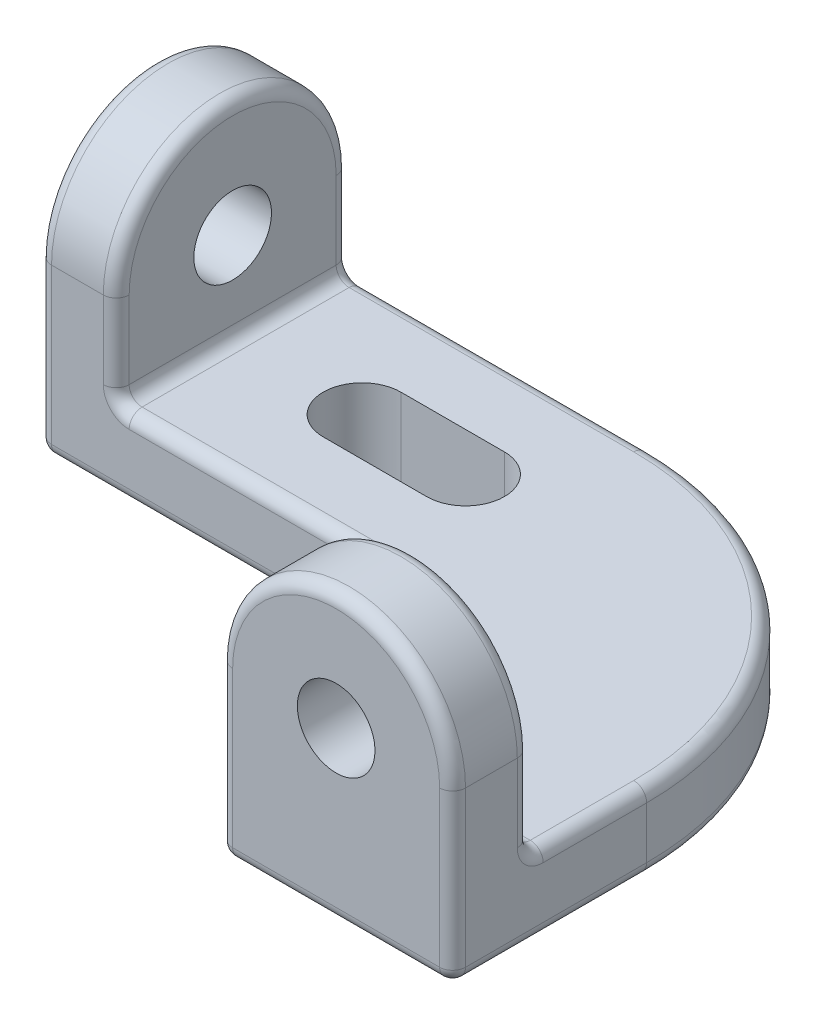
ISO-10303-21;
HEADER;
FILE_DESCRIPTION(('STEP AP214'),'2;1');
FILE_NAME('part.step','',(''),(''),'','','');
FILE_SCHEMA(('AUTOMOTIVE_DESIGN { 1 0 10303 214 1 1 1 1 }'));
ENDSEC;
DATA;
#1=APPLICATION_CONTEXT('core data for automotive mechanical design processes');
#2=APPLICATION_PROTOCOL_DEFINITION('international standard','automotive_design',2000,#1);
#3=PRODUCT_CONTEXT('',#1,'mechanical');
#4=PRODUCT('Part','Part','',(#3));
#5=PRODUCT_RELATED_PRODUCT_CATEGORY('part','',(#4));
#6=PRODUCT_DEFINITION_FORMATION('','',#4);
#7=PRODUCT_DEFINITION_CONTEXT('part definition',#1,'design');
#8=PRODUCT_DEFINITION('design','',#6,#7);
#9=PRODUCT_DEFINITION_SHAPE('','',#8);
#10=(LENGTH_UNIT() NAMED_UNIT(*) SI_UNIT(.MILLI.,.METRE.));
#11=(NAMED_UNIT(*) PLANE_ANGLE_UNIT() SI_UNIT($,.RADIAN.));
#12=(NAMED_UNIT(*) SI_UNIT($,.STERADIAN.) SOLID_ANGLE_UNIT());
#13=UNCERTAINTY_MEASURE_WITH_UNIT(LENGTH_MEASURE(1.E-05),#10,'distance_accuracy_value','');
#14=(GEOMETRIC_REPRESENTATION_CONTEXT(3) GLOBAL_UNCERTAINTY_ASSIGNED_CONTEXT((#13)) GLOBAL_UNIT_ASSIGNED_CONTEXT((#10,
#11,#12)) REPRESENTATION_CONTEXT('',''));
#15=CARTESIAN_POINT('',(0.,0.,0.));
#16=DIRECTION('',(0.,0.,1.));
#17=DIRECTION('',(1.,0.,0.));
#18=AXIS2_PLACEMENT_3D('',#15,#16,#17);
#19=CARTESIAN_POINT('',(3.175,41.275,-28.575));
#20=DIRECTION('',(1.,0.,0.));
#21=DIRECTION('',(0.,0.,-1.));
#22=AXIS2_PLACEMENT_3D('',#19,#20,#21);
#23=TOROIDAL_SURFACE('',#22,25.4,3.175);
#24=CARTESIAN_POINT('',(3.175,41.275,-53.975));
#25=DIRECTION('',(0.,1.,0.));
#26=DIRECTION('',(0.,0.,1.));
#27=AXIS2_PLACEMENT_3D('',#24,#25,#26);
#28=CIRCLE('',#27,3.175);
#29=CARTESIAN_POINT('',(3.175,41.275,-57.15));
#30=VERTEX_POINT('',#29);
#31=CARTESIAN_POINT('',(0.,41.275,-53.975));
#32=VERTEX_POINT('',#31);
#33=EDGE_CURVE('E362',#30,#32,#28,.T.);
#34=ORIENTED_EDGE('',*,*,#33,.T.);
#35=CARTESIAN_POINT('',(0.,41.275,-28.575));
#36=DIRECTION('',(1.,0.,0.));
#37=DIRECTION('',(0.,0.,-1.));
#38=AXIS2_PLACEMENT_3D('',#35,#36,#37);
#39=CIRCLE('',#38,25.4);
#40=CARTESIAN_POINT('',(0.,41.275,-3.175));
#41=VERTEX_POINT('',#40);
#42=EDGE_CURVE('E411',#41,#32,#39,.F.);
#43=ORIENTED_EDGE('',*,*,#42,.F.);
#44=CARTESIAN_POINT('',(3.175,41.275,-3.175));
#45=DIRECTION('',(0.,-1.,0.));
#46=DIRECTION('',(0.,0.,-1.));
#47=AXIS2_PLACEMENT_3D('',#44,#45,#46);
#48=CIRCLE('',#47,3.175);
#49=CARTESIAN_POINT('',(3.175,41.275,0.));
#50=VERTEX_POINT('',#49);
#51=EDGE_CURVE('E368',#50,#41,#48,.T.);
#52=ORIENTED_EDGE('',*,*,#51,.F.);
#53=CARTESIAN_POINT('',(3.175,41.275,-28.575));
#54=DIRECTION('',(1.,0.,0.));
#55=DIRECTION('',(0.,0.,-1.));
#56=AXIS2_PLACEMENT_3D('',#53,#54,#55);
#57=CIRCLE('',#56,28.575);
#58=EDGE_CURVE('E425',#30,#50,#57,.T.);
#59=ORIENTED_EDGE('',*,*,#58,.F.);
#60=EDGE_LOOP('',(#34,#43,#52,#59));
#61=FACE_BOUND('',#60,.T.);
#62=ADVANCED_FACE('F36',(#61),#23,.T.);
#63=CARTESIAN_POINT('',(165.101,41.275,-28.575));
#64=DIRECTION('',(-1.,0.,0.));
#65=DIRECTION('',(0.,0.,1.));
#66=AXIS2_PLACEMENT_3D('',#63,#64,#65);
#67=CYLINDRICAL_SURFACE('',#66,9.525);
#68=CARTESIAN_POINT('',(19.05,41.275,-28.575));
#69=DIRECTION('',(1.,0.,0.));
#70=DIRECTION('',(0.,0.,-1.));
#71=AXIS2_PLACEMENT_3D('',#68,#69,#70);
#72=CIRCLE('',#71,9.525);
#73=CARTESIAN_POINT('',(19.05,41.275,-38.1));
#74=VERTEX_POINT('',#73);
#75=EDGE_CURVE('E500',#74,#74,#72,.F.);
#76=ORIENTED_EDGE('',*,*,#75,.F.);
#77=EDGE_LOOP('',(#76));
#78=FACE_BOUND('',#77,.T.);
#79=CARTESIAN_POINT('',(0.,41.275,-28.575));
#80=DIRECTION('',(-1.,0.,0.));
#81=DIRECTION('',(0.,0.,1.));
#82=AXIS2_PLACEMENT_3D('',#79,#80,#81);
#83=CIRCLE('',#82,9.525);
#84=CARTESIAN_POINT('',(0.,41.275,-19.05));
#85=VERTEX_POINT('',#84);
#86=EDGE_CURVE('E499',#85,#85,#83,.T.);
#87=ORIENTED_EDGE('',*,*,#86,.T.);
#88=EDGE_LOOP('',(#87));
#89=FACE_BOUND('',#88,.T.);
#90=ADVANCED_FACE('F649',(#78,#89),#67,.F.);
#91=CARTESIAN_POINT('',(15.875,41.275,-28.575));
#92=DIRECTION('',(1.,0.,0.));
#93=DIRECTION('',(0.,0.,-1.));
#94=AXIS2_PLACEMENT_3D('',#91,#92,#93);
#95=TOROIDAL_SURFACE('',#94,25.4,3.175);
#96=CARTESIAN_POINT('',(15.875,41.275,-3.175));
#97=DIRECTION('',(0.,1.,0.));
#98=DIRECTION('',(0.,0.,1.));
#99=AXIS2_PLACEMENT_3D('',#96,#97,#98);
#100=CIRCLE('',#99,3.175);
#101=CARTESIAN_POINT('',(15.875,41.275,0.));
#102=VERTEX_POINT('',#101);
#103=CARTESIAN_POINT('',(19.05,41.275,-3.175));
#104=VERTEX_POINT('',#103);
#105=EDGE_CURVE('E388',#102,#104,#100,.T.);
#106=ORIENTED_EDGE('',*,*,#105,.T.);
#107=CARTESIAN_POINT('',(19.05,41.275,-28.575));
#108=DIRECTION('',(1.,0.,0.));
#109=DIRECTION('',(0.,0.,-1.));
#110=AXIS2_PLACEMENT_3D('',#107,#108,#109);
#111=CIRCLE('',#110,25.4);
#112=CARTESIAN_POINT('',(19.05,41.275,-53.975));
#113=VERTEX_POINT('',#112);
#114=EDGE_CURVE('E453',#113,#104,#111,.T.);
#115=ORIENTED_EDGE('',*,*,#114,.F.);
#116=CARTESIAN_POINT('',(15.875,41.275,-53.975));
#117=DIRECTION('',(0.,-1.,0.));
#118=DIRECTION('',(0.,0.,-1.));
#119=AXIS2_PLACEMENT_3D('',#116,#117,#118);
#120=CIRCLE('',#119,3.175);
#121=CARTESIAN_POINT('',(15.875,41.275,-57.15));
#122=VERTEX_POINT('',#121);
#123=EDGE_CURVE('E394',#122,#113,#120,.T.);
#124=ORIENTED_EDGE('',*,*,#123,.F.);
#125=CARTESIAN_POINT('',(15.875,41.275,-28.575));
#126=DIRECTION('',(1.,0.,0.));
#127=DIRECTION('',(0.,0.,-1.));
#128=AXIS2_PLACEMENT_3D('',#125,#126,#127);
#129=CIRCLE('',#128,28.575);
#130=EDGE_CURVE('E423',#102,#122,#129,.F.);
#131=ORIENTED_EDGE('',*,*,#130,.F.);
#132=EDGE_LOOP('',(#106,#115,#124,#131));
#133=FACE_BOUND('',#132,.T.);
#134=ADVANCED_FACE('F647',(#133),#95,.T.);
#135=CARTESIAN_POINT('',(0.,41.275,-28.575));
#136=DIRECTION('',(1.,0.,0.));
#137=DIRECTION('',(0.,0.,-1.));
#138=AXIS2_PLACEMENT_3D('',#135,#136,#137);
#139=PLANE('',#138);
#140=ORIENTED_EDGE('',*,*,#42,.T.);
#141=DIRECTION('',(0.,1.,0.));
#142=VECTOR('',#141,1.);
#143=CARTESIAN_POINT('',(0.,41.275,-53.975));
#144=LINE('',#143,#142);
#145=CARTESIAN_POINT('',(0.,3.175,-53.975));
#146=VERTEX_POINT('',#145);
#147=EDGE_CURVE('E408',#32,#146,#144,.F.);
#148=ORIENTED_EDGE('',*,*,#147,.T.);
#149=DIRECTION('',(0.,0.,-1.));
#150=VECTOR('',#149,1.);
#151=CARTESIAN_POINT('',(0.,3.175,-28.575));
#152=LINE('',#151,#150);
#153=CARTESIAN_POINT('',(0.,3.175,-3.175));
#154=VERTEX_POINT('',#153);
#155=EDGE_CURVE('E414',#146,#154,#152,.F.);
#156=ORIENTED_EDGE('',*,*,#155,.T.);
#157=DIRECTION('',(0.,-1.,0.));
#158=VECTOR('',#157,1.);
#159=CARTESIAN_POINT('',(0.,41.275,-3.175));
#160=LINE('',#159,#158);
#161=EDGE_CURVE('E416',#154,#41,#160,.F.);
#162=ORIENTED_EDGE('',*,*,#161,.T.);
#163=EDGE_LOOP('',(#140,#148,#156,#162));
#164=FACE_BOUND('',#163,.T.);
#165=ORIENTED_EDGE('',*,*,#86,.F.);
#166=EDGE_LOOP('',(#165));
#167=FACE_BOUND('',#166,.T.);
#168=ADVANCED_FACE('F629',(#164,#167),#139,.F.);
#169=CARTESIAN_POINT('',(3.175,41.275,-3.175));
#170=DIRECTION('',(0.,-1.,0.));
#171=DIRECTION('',(0.,0.,-1.));
#172=AXIS2_PLACEMENT_3D('',#169,#170,#171);
#173=CYLINDRICAL_SURFACE('',#172,3.175);
#174=ORIENTED_EDGE('',*,*,#51,.T.);
#175=ORIENTED_EDGE('',*,*,#161,.F.);
#176=CARTESIAN_POINT('',(3.175,3.175,-3.175));
#177=DIRECTION('',(0.,-1.,0.));
#178=DIRECTION('',(0.,0.,-1.));
#179=AXIS2_PLACEMENT_3D('',#176,#177,#178);
#180=CIRCLE('',#179,3.175);
#181=CARTESIAN_POINT('',(3.175,3.175,0.));
#182=VERTEX_POINT('',#181);
#183=EDGE_CURVE('E374',#182,#154,#180,.T.);
#184=ORIENTED_EDGE('',*,*,#183,.F.);
#185=DIRECTION('',(0.,-1.,0.));
#186=VECTOR('',#185,1.);
#187=CARTESIAN_POINT('',(3.175,41.275,0.));
#188=LINE('',#187,#186);
#189=EDGE_CURVE('E437',#50,#182,#188,.T.);
#190=ORIENTED_EDGE('',*,*,#189,.F.);
#191=EDGE_LOOP('',(#174,#175,#184,#190));
#192=FACE_BOUND('',#191,.T.);
#193=ADVANCED_FACE('F638',(#192),#173,.T.);
#194=CARTESIAN_POINT('',(15.875,41.275,-3.175));
#195=DIRECTION('',(0.,1.,0.));
#196=DIRECTION('',(0.,0.,1.));
#197=AXIS2_PLACEMENT_3D('',#194,#195,#196);
#198=CYLINDRICAL_SURFACE('',#197,3.175);
#199=ORIENTED_EDGE('',*,*,#105,.F.);
#200=DIRECTION('',(0.,-1.,0.));
#201=VECTOR('',#200,1.);
#202=CARTESIAN_POINT('',(15.875,41.275,0.));
#203=LINE('',#202,#201);
#204=CARTESIAN_POINT('',(15.875,22.225,0.));
#205=VERTEX_POINT('',#204);
#206=EDGE_CURVE('E427',#205,#102,#203,.F.);
#207=ORIENTED_EDGE('',*,*,#206,.F.);
#208=CARTESIAN_POINT('',(15.875,22.225,-3.175));
#209=DIRECTION('',(0.,-1.,0.));
#210=DIRECTION('',(0.,0.,-1.));
#211=AXIS2_PLACEMENT_3D('',#208,#209,#210);
#212=CIRCLE('',#211,3.175);
#213=CARTESIAN_POINT('',(19.05,22.225,-3.175));
#214=VERTEX_POINT('',#213);
#215=EDGE_CURVE('E385',#214,#205,#212,.T.);
#216=ORIENTED_EDGE('',*,*,#215,.F.);
#217=DIRECTION('',(0.,-1.,0.));
#218=VECTOR('',#217,1.);
#219=CARTESIAN_POINT('',(19.05,19.05,-3.175));
#220=LINE('',#219,#218);
#221=EDGE_CURVE('E455',#104,#214,#220,.T.);
#222=ORIENTED_EDGE('',*,*,#221,.F.);
#223=EDGE_LOOP('',(#199,#207,#216,#222));
#224=FACE_BOUND('',#223,.T.);
#225=ADVANCED_FACE('F582',(#224),#198,.T.);
#226=CARTESIAN_POINT('',(15.875,41.275,-53.975));
#227=DIRECTION('',(0.,-1.,0.));
#228=DIRECTION('',(0.,0.,-1.));
#229=AXIS2_PLACEMENT_3D('',#226,#227,#228);
#230=CYLINDRICAL_SURFACE('',#229,3.175);
#231=ORIENTED_EDGE('',*,*,#123,.T.);
#232=DIRECTION('',(0.,1.,0.));
#233=VECTOR('',#232,1.);
#234=CARTESIAN_POINT('',(19.05,41.275,-53.975));
#235=LINE('',#234,#233);
#236=CARTESIAN_POINT('',(19.05,22.225,-53.975));
#237=VERTEX_POINT('',#236);
#238=EDGE_CURVE('E450',#237,#113,#235,.T.);
#239=ORIENTED_EDGE('',*,*,#238,.F.);
#240=CARTESIAN_POINT('',(15.875,22.225,-53.975));
#241=DIRECTION('',(0.,-1.,0.));
#242=DIRECTION('',(0.,0.,-1.));
#243=AXIS2_PLACEMENT_3D('',#240,#241,#242);
#244=CIRCLE('',#243,3.175);
#245=CARTESIAN_POINT('',(15.875,22.225,-57.15));
#246=VERTEX_POINT('',#245);
#247=EDGE_CURVE('E399',#246,#237,#244,.T.);
#248=ORIENTED_EDGE('',*,*,#247,.F.);
#249=DIRECTION('',(0.,1.,0.));
#250=VECTOR('',#249,1.);
#251=CARTESIAN_POINT('',(15.875,19.05,-57.15));
#252=LINE('',#251,#250);
#253=EDGE_CURVE('E461',#122,#246,#252,.F.);
#254=ORIENTED_EDGE('',*,*,#253,.F.);
#255=EDGE_LOOP('',(#231,#239,#248,#254));
#256=FACE_BOUND('',#255,.T.);
#257=ADVANCED_FACE('F571',(#256),#230,.T.);
#258=CARTESIAN_POINT('',(19.05,41.275,-28.575));
#259=DIRECTION('',(-1.,0.,0.));
#260=DIRECTION('',(0.,0.,1.));
#261=AXIS2_PLACEMENT_3D('',#258,#259,#260);
#262=CYLINDRICAL_SURFACE('',#261,28.575);
#263=DIRECTION('',(-1.,0.,0.));
#264=VECTOR('',#263,1.);
#265=CARTESIAN_POINT('',(19.05,41.275,0.));
#266=LINE('',#265,#264);
#267=EDGE_CURVE('E489',#102,#50,#266,.T.);
#268=ORIENTED_EDGE('',*,*,#267,.F.);
#269=ORIENTED_EDGE('',*,*,#130,.T.);
#270=DIRECTION('',(-1.,0.,0.));
#271=VECTOR('',#270,1.);
#272=CARTESIAN_POINT('',(19.05,41.275,-57.15));
#273=LINE('',#272,#271);
#274=EDGE_CURVE('E486',#122,#30,#273,.T.);
#275=ORIENTED_EDGE('',*,*,#274,.T.);
#276=ORIENTED_EDGE('',*,*,#58,.T.);
#277=EDGE_LOOP('',(#268,#269,#275,#276));
#278=FACE_BOUND('',#277,.T.);
#279=ADVANCED_FACE('F643',(#278),#262,.T.);
#280=CARTESIAN_POINT('',(3.175,0.,-53.975));
#281=DIRECTION('',(0.,1.,0.));
#282=DIRECTION('',(0.,0.,1.));
#283=AXIS2_PLACEMENT_3D('',#280,#281,#282);
#284=CYLINDRICAL_SURFACE('',#283,3.175);
#285=ORIENTED_EDGE('',*,*,#33,.F.);
#286=DIRECTION('',(0.,1.,0.));
#287=VECTOR('',#286,1.);
#288=CARTESIAN_POINT('',(3.175,0.,-57.15));
#289=LINE('',#288,#287);
#290=CARTESIAN_POINT('',(3.175,3.175,-57.15));
#291=VERTEX_POINT('',#290);
#292=EDGE_CURVE('E468',#291,#30,#289,.T.);
#293=ORIENTED_EDGE('',*,*,#292,.F.);
#294=CARTESIAN_POINT('',(3.175,3.175,-53.975));
#295=DIRECTION('',(0.,-1.,0.));
#296=DIRECTION('',(0.,0.,-1.));
#297=AXIS2_PLACEMENT_3D('',#294,#295,#296);
#298=CIRCLE('',#297,3.175);
#299=EDGE_CURVE('E359',#146,#291,#298,.T.);
#300=ORIENTED_EDGE('',*,*,#299,.F.);
#301=ORIENTED_EDGE('',*,*,#147,.F.);
#302=EDGE_LOOP('',(#285,#293,#300,#301));
#303=FACE_BOUND('',#302,.T.);
#304=ADVANCED_FACE('F627',(#303),#284,.T.);
#305=CARTESIAN_POINT('',(19.05,41.275,-28.575));
#306=DIRECTION('',(1.,0.,0.));
#307=DIRECTION('',(0.,0.,-1.));
#308=AXIS2_PLACEMENT_3D('',#305,#306,#307);
#309=PLANE('',#308);
#310=DIRECTION('',(0.,0.,1.));
#311=VECTOR('',#310,1.);
#312=CARTESIAN_POINT('',(19.05,22.225,-57.15));
#313=LINE('',#312,#311);
#314=EDGE_CURVE('E457',#214,#237,#313,.F.);
#315=ORIENTED_EDGE('',*,*,#314,.T.);
#316=ORIENTED_EDGE('',*,*,#238,.T.);
#317=ORIENTED_EDGE('',*,*,#114,.T.);
#318=ORIENTED_EDGE('',*,*,#221,.T.);
#319=EDGE_LOOP('',(#315,#316,#317,#318));
#320=FACE_BOUND('',#319,.T.);
#321=ORIENTED_EDGE('',*,*,#75,.T.);
#322=EDGE_LOOP('',(#321));
#323=FACE_BOUND('',#322,.T.);
#324=ADVANCED_FACE('F575',(#320,#323),#309,.T.);
#325=CARTESIAN_POINT('',(22.225,22.225,-3.175));
#326=DIRECTION('',(0.,0.,-1.));
#327=DIRECTION('',(0.,1.,0.));
#328=AXIS2_PLACEMENT_3D('',#325,#326,#327);
#329=TOROIDAL_SURFACE('',#328,6.35,3.175);
#330=CARTESIAN_POINT('',(22.225,22.225,0.));
#331=DIRECTION('',(0.,0.,-1.));
#332=DIRECTION('',(0.,1.,0.));
#333=AXIS2_PLACEMENT_3D('',#330,#331,#332);
#334=CIRCLE('',#333,6.35);
#335=CARTESIAN_POINT('',(22.225,15.875,0.));
#336=VERTEX_POINT('',#335);
#337=EDGE_CURVE('E431',#205,#336,#334,.F.);
#338=ORIENTED_EDGE('',*,*,#337,.T.);
#339=CARTESIAN_POINT('',(22.225,15.875,-3.175));
#340=DIRECTION('',(-1.,0.,0.));
#341=DIRECTION('',(0.,0.,1.));
#342=AXIS2_PLACEMENT_3D('',#339,#340,#341);
#343=CIRCLE('',#342,3.175);
#344=CARTESIAN_POINT('',(22.225,19.05,-3.175));
#345=VERTEX_POINT('',#344);
#346=EDGE_CURVE('E381',#336,#345,#343,.T.);
#347=ORIENTED_EDGE('',*,*,#346,.T.);
#348=CARTESIAN_POINT('',(22.225,22.225,-3.175));
#349=DIRECTION('',(0.,0.,-1.));
#350=DIRECTION('',(0.,1.,0.));
#351=AXIS2_PLACEMENT_3D('',#348,#349,#350);
#352=CIRCLE('',#351,3.175);
#353=EDGE_CURVE('E391',#214,#345,#352,.F.);
#354=ORIENTED_EDGE('',*,*,#353,.F.);
#355=ORIENTED_EDGE('',*,*,#215,.T.);
#356=EDGE_LOOP('',(#338,#347,#354,#355));
#357=FACE_BOUND('',#356,.T.);
#358=ADVANCED_FACE('F584',(#357),#329,.T.);
#359=CARTESIAN_POINT('',(22.225,22.225,-53.975));
#360=DIRECTION('',(0.,0.,1.));
#361=DIRECTION('',(1.,0.,0.));
#362=AXIS2_PLACEMENT_3D('',#359,#360,#361);
#363=TOROIDAL_SURFACE('',#362,6.35,3.175);
#364=ORIENTED_EDGE('',*,*,#247,.T.);
#365=CARTESIAN_POINT('',(22.225,22.225,-53.975));
#366=DIRECTION('',(0.,0.,1.));
#367=DIRECTION('',(1.,0.,0.));
#368=AXIS2_PLACEMENT_3D('',#365,#366,#367);
#369=CIRCLE('',#368,3.175);
#370=CARTESIAN_POINT('',(22.225,19.05,-53.975));
#371=VERTEX_POINT('',#370);
#372=EDGE_CURVE('E396',#237,#371,#369,.T.);
#373=ORIENTED_EDGE('',*,*,#372,.T.);
#374=CARTESIAN_POINT('',(22.225,15.875,-53.975));
#375=DIRECTION('',(-1.,0.,0.));
#376=DIRECTION('',(0.,0.,1.));
#377=AXIS2_PLACEMENT_3D('',#374,#375,#376);
#378=CIRCLE('',#377,3.175);
#379=CARTESIAN_POINT('',(22.225,15.875,-57.15));
#380=VERTEX_POINT('',#379);
#381=EDGE_CURVE('E402',#380,#371,#378,.F.);
#382=ORIENTED_EDGE('',*,*,#381,.F.);
#383=CARTESIAN_POINT('',(22.225,22.225,-57.15));
#384=DIRECTION('',(0.,0.,1.));
#385=DIRECTION('',(1.,0.,0.));
#386=AXIS2_PLACEMENT_3D('',#383,#384,#385);
#387=CIRCLE('',#386,6.35);
#388=EDGE_CURVE('E463',#380,#246,#387,.F.);
#389=ORIENTED_EDGE('',*,*,#388,.T.);
#390=EDGE_LOOP('',(#364,#373,#382,#389));
#391=FACE_BOUND('',#390,.T.);
#392=ADVANCED_FACE('F566',(#391),#363,.T.);
#393=CARTESIAN_POINT('',(3.175,3.175,-53.975));
#394=DIRECTION('',(0.,0.,1.));
#395=DIRECTION('',(1.,0.,0.));
#396=AXIS2_PLACEMENT_3D('',#393,#394,#395);
#397=SPHERICAL_SURFACE('',#396,3.175);
#398=ORIENTED_EDGE('',*,*,#299,.T.);
#399=CARTESIAN_POINT('',(3.175,3.175,-53.975));
#400=DIRECTION('',(-1.,0.,0.));
#401=DIRECTION('',(0.,0.,1.));
#402=AXIS2_PLACEMENT_3D('',#399,#400,#401);
#403=CIRCLE('',#402,3.175);
#404=CARTESIAN_POINT('',(3.175,0.,-53.975));
#405=VERTEX_POINT('',#404);
#406=EDGE_CURVE('E355',#291,#405,#403,.T.);
#407=ORIENTED_EDGE('',*,*,#406,.T.);
#408=CARTESIAN_POINT('',(3.175,3.175,-53.975));
#409=DIRECTION('',(0.,0.,-1.));
#410=DIRECTION('',(-1.,0.,0.));
#411=AXIS2_PLACEMENT_3D('',#408,#409,#410);
#412=CIRCLE('',#411,3.175);
#413=EDGE_CURVE('E365',#146,#405,#412,.F.);
#414=ORIENTED_EDGE('',*,*,#413,.F.);
#415=EDGE_LOOP('',(#398,#407,#414));
#416=FACE_BOUND('',#415,.T.);
#417=ADVANCED_FACE('F621',(#416),#397,.T.);
#418=CARTESIAN_POINT('',(3.175,3.175,-3.175));
#419=DIRECTION('',(0.,0.,1.));
#420=DIRECTION('',(1.,0.,0.));
#421=AXIS2_PLACEMENT_3D('',#418,#419,#420);
#422=SPHERICAL_SURFACE('',#421,3.175);
#423=ORIENTED_EDGE('',*,*,#183,.T.);
#424=CARTESIAN_POINT('',(3.175,3.175,-3.175));
#425=DIRECTION('',(0.,0.,1.));
#426=DIRECTION('',(1.,0.,0.));
#427=AXIS2_PLACEMENT_3D('',#424,#425,#426);
#428=CIRCLE('',#427,3.175);
#429=CARTESIAN_POINT('',(3.175,0.,-3.175));
#430=VERTEX_POINT('',#429);
#431=EDGE_CURVE('E371',#154,#430,#428,.T.);
#432=ORIENTED_EDGE('',*,*,#431,.T.);
#433=CARTESIAN_POINT('',(3.175,3.175,-3.175));
#434=DIRECTION('',(-1.,0.,0.));
#435=DIRECTION('',(0.,0.,1.));
#436=AXIS2_PLACEMENT_3D('',#433,#434,#435);
#437=CIRCLE('',#436,3.175);
#438=EDGE_CURVE('E11',#182,#430,#437,.F.);
#439=ORIENTED_EDGE('',*,*,#438,.F.);
#440=EDGE_LOOP('',(#423,#432,#439));
#441=FACE_BOUND('',#440,.T.);
#442=ADVANCED_FACE('F614',(#441),#422,.T.);
#443=CARTESIAN_POINT('',(3.175,3.175,0.));
#444=DIRECTION('',(0.,0.,-1.));
#445=DIRECTION('',(-1.,0.,0.));
#446=AXIS2_PLACEMENT_3D('',#443,#444,#445);
#447=CYLINDRICAL_SURFACE('',#446,3.175);
#448=ORIENTED_EDGE('',*,*,#413,.T.);
#449=DIRECTION('',(0.,0.,-1.));
#450=VECTOR('',#449,1.);
#451=CARTESIAN_POINT('',(3.175,0.,0.));
#452=LINE('',#451,#450);
#453=EDGE_CURVE('E439',#430,#405,#452,.T.);
#454=ORIENTED_EDGE('',*,*,#453,.F.);
#455=ORIENTED_EDGE('',*,*,#431,.F.);
#456=ORIENTED_EDGE('',*,*,#155,.F.);
#457=EDGE_LOOP('',(#448,#454,#455,#456));
#458=FACE_BOUND('',#457,.T.);
#459=ADVANCED_FACE('F617',(#458),#447,.T.);
#460=CARTESIAN_POINT('',(19.05,41.275,0.));
#461=DIRECTION('',(0.,0.,-1.));
#462=DIRECTION('',(0.,1.,0.));
#463=AXIS2_PLACEMENT_3D('',#460,#461,#462);
#464=PLANE('',#463);
#465=ORIENTED_EDGE('',*,*,#337,.F.);
#466=ORIENTED_EDGE('',*,*,#206,.T.);
#467=ORIENTED_EDGE('',*,*,#267,.T.);
#468=ORIENTED_EDGE('',*,*,#189,.T.);
#469=DIRECTION('',(-1.,0.,0.));
#470=VECTOR('',#469,1.);
#471=CARTESIAN_POINT('',(19.05,3.175,0.));
#472=LINE('',#471,#470);
#473=CARTESIAN_POINT('',(92.075,3.175,0.));
#474=VERTEX_POINT('',#473);
#475=EDGE_CURVE('E434',#182,#474,#472,.F.);
#476=ORIENTED_EDGE('',*,*,#475,.T.);
#477=DIRECTION('',(0.,-1.,0.));
#478=VECTOR('',#477,1.);
#479=CARTESIAN_POINT('',(92.075,19.05,0.));
#480=LINE('',#479,#478);
#481=CARTESIAN_POINT('',(92.075,15.875,0.));
#482=VERTEX_POINT('',#481);
#483=EDGE_CURVE('E492',#482,#474,#480,.T.);
#484=ORIENTED_EDGE('',*,*,#483,.F.);
#485=DIRECTION('',(1.,0.,0.));
#486=VECTOR('',#485,1.);
#487=CARTESIAN_POINT('',(19.05,15.875,0.));
#488=LINE('',#487,#486);
#489=EDGE_CURVE('E429',#482,#336,#488,.F.);
#490=ORIENTED_EDGE('',*,*,#489,.T.);
#491=EDGE_LOOP('',(#465,#466,#467,#468,#476,#484,#490));
#492=FACE_BOUND('',#491,.T.);
#493=ADVANCED_FACE('F640',(#492),#464,.F.);
#494=CARTESIAN_POINT('',(19.05,0.,-57.15));
#495=DIRECTION('',(0.,0.,1.));
#496=DIRECTION('',(1.,0.,0.));
#497=AXIS2_PLACEMENT_3D('',#494,#495,#496);
#498=PLANE('',#497);
#499=ORIENTED_EDGE('',*,*,#388,.F.);
#500=DIRECTION('',(-1.,0.,0.));
#501=VECTOR('',#500,1.);
#502=CARTESIAN_POINT('',(92.075,15.875,-57.15));
#503=LINE('',#502,#501);
#504=CARTESIAN_POINT('',(92.075,15.875,-57.15));
#505=VERTEX_POINT('',#504);
#506=EDGE_CURVE('E459',#380,#505,#503,.F.);
#507=ORIENTED_EDGE('',*,*,#506,.T.);
#508=DIRECTION('',(0.,-1.,0.));
#509=VECTOR('',#508,1.);
#510=CARTESIAN_POINT('',(92.075,19.05,-57.15));
#511=LINE('',#510,#509);
#512=CARTESIAN_POINT('',(92.075,3.175,-57.15));
#513=VERTEX_POINT('',#512);
#514=EDGE_CURVE('E496',#505,#513,#511,.T.);
#515=ORIENTED_EDGE('',*,*,#514,.T.);
#516=DIRECTION('',(-1.,0.,0.));
#517=VECTOR('',#516,1.);
#518=CARTESIAN_POINT('',(19.05,3.175,-57.15));
#519=LINE('',#518,#517);
#520=EDGE_CURVE('E466',#513,#291,#519,.T.);
#521=ORIENTED_EDGE('',*,*,#520,.T.);
#522=ORIENTED_EDGE('',*,*,#292,.T.);
#523=ORIENTED_EDGE('',*,*,#274,.F.);
#524=ORIENTED_EDGE('',*,*,#253,.T.);
#525=EDGE_LOOP('',(#499,#507,#515,#521,#522,#523,#524));
#526=FACE_BOUND('',#525,.T.);
#527=ADVANCED_FACE('F888',(#526),#498,.F.);
#528=CARTESIAN_POINT('',(22.225,22.225,15.875));
#529=DIRECTION('',(0.,0.,-1.));
#530=DIRECTION('',(-1.,0.,0.));
#531=AXIS2_PLACEMENT_3D('',#528,#529,#530);
#532=CYLINDRICAL_SURFACE('',#531,3.175);
#533=ORIENTED_EDGE('',*,*,#353,.T.);
#534=DIRECTION('',(0.,0.,1.));
#535=VECTOR('',#534,1.);
#536=CARTESIAN_POINT('',(22.225,19.05,0.));
#537=LINE('',#536,#535);
#538=EDGE_CURVE('E484',#371,#345,#537,.T.);
#539=ORIENTED_EDGE('',*,*,#538,.F.);
#540=ORIENTED_EDGE('',*,*,#372,.F.);
#541=ORIENTED_EDGE('',*,*,#314,.F.);
#542=EDGE_LOOP('',(#533,#539,#540,#541));
#543=FACE_BOUND('',#542,.T.);
#544=ADVANCED_FACE('F562',(#543),#532,.F.);
#545=CARTESIAN_POINT('',(50.8,-50.801,-19.05));
#546=DIRECTION('',(0.,0.,1.));
#547=DIRECTION('',(1.,0.,0.));
#548=AXIS2_PLACEMENT_3D('',#545,#546,#547);
#549=PLANE('',#548);
#550=DIRECTION('',(-1.,0.,0.));
#551=VECTOR('',#550,1.);
#552=CARTESIAN_POINT('',(50.8,0.,-19.05));
#553=LINE('',#552,#551);
#554=CARTESIAN_POINT('',(76.2,0.,-19.05));
#555=VERTEX_POINT('',#554);
#556=CARTESIAN_POINT('',(50.8,0.,-19.05));
#557=VERTEX_POINT('',#556);
#558=EDGE_CURVE('E503',#555,#557,#553,.T.);
#559=ORIENTED_EDGE('',*,*,#558,.T.);
#560=DIRECTION('',(0.,1.,0.));
#561=VECTOR('',#560,1.);
#562=CARTESIAN_POINT('',(50.8,-50.801,-19.05));
#563=LINE('',#562,#561);
#564=CARTESIAN_POINT('',(50.8,19.05,-19.05));
#565=VERTEX_POINT('',#564);
#566=EDGE_CURVE('E53',#557,#565,#563,.T.);
#567=ORIENTED_EDGE('',*,*,#566,.T.);
#568=DIRECTION('',(1.,0.,0.));
#569=VECTOR('',#568,1.);
#570=CARTESIAN_POINT('',(50.8,19.05,-19.05));
#571=LINE('',#570,#569);
#572=CARTESIAN_POINT('',(76.2,19.05,-19.05));
#573=VERTEX_POINT('',#572);
#574=EDGE_CURVE('E518',#565,#573,#571,.T.);
#575=ORIENTED_EDGE('',*,*,#574,.T.);
#576=DIRECTION('',(0.,1.,0.));
#577=VECTOR('',#576,1.);
#578=CARTESIAN_POINT('',(76.2,-50.801,-19.05));
#579=LINE('',#578,#577);
#580=EDGE_CURVE('E61',#555,#573,#579,.T.);
#581=ORIENTED_EDGE('',*,*,#580,.F.);
#582=EDGE_LOOP('',(#559,#567,#575,#581));
#583=FACE_BOUND('',#582,.T.);
#584=ADVANCED_FACE('F706',(#583),#549,.F.);
#585=CARTESIAN_POINT('',(76.2,-50.801,-28.575));
#586=DIRECTION('',(0.,1.,0.));
#587=DIRECTION('',(0.,0.,1.));
#588=AXIS2_PLACEMENT_3D('',#585,#586,#587);
#589=CYLINDRICAL_SURFACE('',#588,9.525);
#590=CARTESIAN_POINT('',(76.2,0.,-28.575));
#591=DIRECTION('',(0.,1.,0.));
#592=DIRECTION('',(0.,0.,1.));
#593=AXIS2_PLACEMENT_3D('',#590,#591,#592);
#594=CIRCLE('',#593,9.525);
#595=CARTESIAN_POINT('',(76.2,0.,-38.1));
#596=VERTEX_POINT('',#595);
#597=EDGE_CURVE('E382',#596,#555,#594,.F.);
#598=ORIENTED_EDGE('',*,*,#597,.T.);
#599=ORIENTED_EDGE('',*,*,#580,.T.);
#600=CARTESIAN_POINT('',(76.2,19.05,-28.575));
#601=DIRECTION('',(0.,1.,0.));
#602=DIRECTION('',(0.,0.,1.));
#603=AXIS2_PLACEMENT_3D('',#600,#601,#602);
#604=CIRCLE('',#603,9.525);
#605=CARTESIAN_POINT('',(76.2,19.05,-38.1));
#606=VERTEX_POINT('',#605);
#607=EDGE_CURVE('E516',#573,#606,#604,.T.);
#608=ORIENTED_EDGE('',*,*,#607,.T.);
#609=DIRECTION('',(0.,1.,0.));
#610=VECTOR('',#609,1.);
#611=CARTESIAN_POINT('',(76.2,-50.801,-38.1));
#612=LINE('',#611,#610);
#613=EDGE_CURVE('E511',#596,#606,#612,.T.);
#614=ORIENTED_EDGE('',*,*,#613,.F.);
#615=EDGE_LOOP('',(#598,#599,#608,#614));
#616=FACE_BOUND('',#615,.T.);
#617=ADVANCED_FACE('F709',(#616),#589,.F.);
#618=CARTESIAN_POINT('',(50.8,-50.801,-38.1));
#619=DIRECTION('',(0.,0.,-1.));
#620=DIRECTION('',(-1.,0.,0.));
#621=AXIS2_PLACEMENT_3D('',#618,#619,#620);
#622=PLANE('',#621);
#623=DIRECTION('',(1.,0.,0.));
#624=VECTOR('',#623,1.);
#625=CARTESIAN_POINT('',(50.8,0.,-38.1));
#626=LINE('',#625,#624);
#627=CARTESIAN_POINT('',(50.8,0.,-38.1));
#628=VERTEX_POINT('',#627);
#629=EDGE_CURVE('E524',#628,#596,#626,.T.);
#630=ORIENTED_EDGE('',*,*,#629,.T.);
#631=ORIENTED_EDGE('',*,*,#613,.T.);
#632=DIRECTION('',(-1.,0.,0.));
#633=VECTOR('',#632,1.);
#634=CARTESIAN_POINT('',(50.8,19.05,-38.1));
#635=LINE('',#634,#633);
#636=CARTESIAN_POINT('',(50.8,19.05,-38.1));
#637=VERTEX_POINT('',#636);
#638=EDGE_CURVE('E509',#606,#637,#635,.T.);
#639=ORIENTED_EDGE('',*,*,#638,.T.);
#640=DIRECTION('',(0.,1.,0.));
#641=VECTOR('',#640,1.);
#642=CARTESIAN_POINT('',(50.8,-50.801,-38.1));
#643=LINE('',#642,#641);
#644=EDGE_CURVE('E507',#628,#637,#643,.T.);
#645=ORIENTED_EDGE('',*,*,#644,.F.);
#646=EDGE_LOOP('',(#630,#631,#639,#645));
#647=FACE_BOUND('',#646,.T.);
#648=ADVANCED_FACE('F705',(#647),#622,.F.);
#649=CARTESIAN_POINT('',(50.8,-50.801,-28.575));
#650=DIRECTION('',(0.,1.,0.));
#651=DIRECTION('',(0.,0.,1.));
#652=AXIS2_PLACEMENT_3D('',#649,#650,#651);
#653=CYLINDRICAL_SURFACE('',#652,9.525);
#654=CARTESIAN_POINT('',(50.8,0.,-28.575));
#655=DIRECTION('',(0.,1.,0.));
#656=DIRECTION('',(0.,0.,1.));
#657=AXIS2_PLACEMENT_3D('',#654,#655,#656);
#658=CIRCLE('',#657,9.525);
#659=EDGE_CURVE('E522',#557,#628,#658,.F.);
#660=ORIENTED_EDGE('',*,*,#659,.T.);
#661=ORIENTED_EDGE('',*,*,#644,.T.);
#662=CARTESIAN_POINT('',(50.8,19.05,-28.575));
#663=DIRECTION('',(0.,1.,0.));
#664=DIRECTION('',(0.,0.,1.));
#665=AXIS2_PLACEMENT_3D('',#662,#663,#664);
#666=CIRCLE('',#665,9.525);
#667=EDGE_CURVE('E520',#637,#565,#666,.T.);
#668=ORIENTED_EDGE('',*,*,#667,.T.);
#669=ORIENTED_EDGE('',*,*,#566,.F.);
#670=EDGE_LOOP('',(#660,#661,#668,#669));
#671=FACE_BOUND('',#670,.T.);
#672=ADVANCED_FACE('F700',(#671),#653,.F.);
#673=CARTESIAN_POINT('',(92.075,19.05,15.875));
#674=DIRECTION('',(0.,-1.,0.));
#675=DIRECTION('',(0.,0.,-1.));
#676=AXIS2_PLACEMENT_3D('',#673,#674,#675);
#677=CYLINDRICAL_SURFACE('',#676,73.025);
#678=ORIENTED_EDGE('',*,*,#514,.F.);
#679=CARTESIAN_POINT('',(92.075,15.875,15.875));
#680=DIRECTION('',(0.,1.,0.));
#681=DIRECTION('',(0.,0.,1.));
#682=AXIS2_PLACEMENT_3D('',#679,#680,#681);
#683=CIRCLE('',#682,73.025);
#684=CARTESIAN_POINT('',(165.1,15.875,15.875));
#685=VERTEX_POINT('',#684);
#686=EDGE_CURVE('E470',#505,#685,#683,.F.);
#687=ORIENTED_EDGE('',*,*,#686,.T.);
#688=DIRECTION('',(0.,-1.,0.));
#689=VECTOR('',#688,1.);
#690=CARTESIAN_POINT('',(165.1,19.05,15.875));
#691=LINE('',#690,#689);
#692=CARTESIAN_POINT('',(165.1,3.175,15.875));
#693=VERTEX_POINT('',#692);
#694=EDGE_CURVE('E495',#685,#693,#691,.T.);
#695=ORIENTED_EDGE('',*,*,#694,.T.);
#696=CARTESIAN_POINT('',(92.075,3.175,15.875));
#697=DIRECTION('',(0.,1.,0.));
#698=DIRECTION('',(0.,0.,1.));
#699=AXIS2_PLACEMENT_3D('',#696,#697,#698);
#700=CIRCLE('',#699,73.025);
#701=EDGE_CURVE('E473',#693,#513,#700,.T.);
#702=ORIENTED_EDGE('',*,*,#701,.T.);
#703=EDGE_LOOP('',(#678,#687,#695,#702));
#704=FACE_BOUND('',#703,.T.);
#705=ADVANCED_FACE('F697',(#704),#677,.T.);
#706=CARTESIAN_POINT('',(19.05,3.175,-53.975));
#707=DIRECTION('',(-1.,0.,0.));
#708=DIRECTION('',(0.,0.,1.));
#709=AXIS2_PLACEMENT_3D('',#706,#707,#708);
#710=CYLINDRICAL_SURFACE('',#709,3.175);
#711=CARTESIAN_POINT('',(92.075,3.175,-53.975));
#712=DIRECTION('',(-1.,0.,0.));
#713=DIRECTION('',(0.,0.,1.));
#714=AXIS2_PLACEMENT_3D('',#711,#712,#713);
#715=CIRCLE('',#714,3.175);
#716=CARTESIAN_POINT('',(92.075,0.,-53.975));
#717=VERTEX_POINT('',#716);
#718=EDGE_CURVE('E352',#513,#717,#715,.T.);
#719=ORIENTED_EDGE('',*,*,#718,.T.);
#720=DIRECTION('',(-1.,0.,0.));
#721=VECTOR('',#720,1.);
#722=CARTESIAN_POINT('',(19.05,0.,-53.975));
#723=LINE('',#722,#721);
#724=EDGE_CURVE('E444',#405,#717,#723,.F.);
#725=ORIENTED_EDGE('',*,*,#724,.F.);
#726=ORIENTED_EDGE('',*,*,#406,.F.);
#727=ORIENTED_EDGE('',*,*,#520,.F.);
#728=EDGE_LOOP('',(#719,#725,#726,#727));
#729=FACE_BOUND('',#728,.T.);
#730=ADVANCED_FACE('F699',(#729),#710,.T.);
#731=CARTESIAN_POINT('',(19.05,0.,0.));
#732=DIRECTION('',(0.,1.,0.));
#733=DIRECTION('',(0.,0.,1.));
#734=AXIS2_PLACEMENT_3D('',#731,#732,#733);
#735=PLANE('',#734);
#736=ORIENTED_EDGE('',*,*,#629,.F.);
#737=ORIENTED_EDGE('',*,*,#659,.F.);
#738=ORIENTED_EDGE('',*,*,#558,.F.);
#739=ORIENTED_EDGE('',*,*,#597,.F.);
#740=EDGE_LOOP('',(#736,#737,#738,#739));
#741=FACE_BOUND('',#740,.T.);
#742=CARTESIAN_POINT('',(92.075,0.,15.875));
#743=DIRECTION('',(0.,1.,0.));
#744=DIRECTION('',(0.,0.,1.));
#745=AXIS2_PLACEMENT_3D('',#742,#743,#744);
#746=CIRCLE('',#745,69.85);
#747=CARTESIAN_POINT('',(161.925,0.,15.875));
#748=VERTEX_POINT('',#747);
#749=EDGE_CURVE('E448',#717,#748,#746,.F.);
#750=ORIENTED_EDGE('',*,*,#749,.T.);
#751=DIRECTION('',(0.,0.,-1.));
#752=VECTOR('',#751,1.);
#753=CARTESIAN_POINT('',(161.925,0.,63.502));
#754=LINE('',#753,#752);
#755=CARTESIAN_POINT('',(161.925,0.,60.325));
#756=VERTEX_POINT('',#755);
#757=EDGE_CURVE('E271',#756,#748,#754,.T.);
#758=ORIENTED_EDGE('',*,*,#757,.F.);
#759=DIRECTION('',(-1.,0.,0.));
#760=VECTOR('',#759,1.);
#761=CARTESIAN_POINT('',(107.95,0.,60.325));
#762=LINE('',#761,#760);
#763=CARTESIAN_POINT('',(111.125,0.,60.325));
#764=VERTEX_POINT('',#763);
#765=EDGE_CURVE('E274',#756,#764,#762,.T.);
#766=ORIENTED_EDGE('',*,*,#765,.T.);
#767=DIRECTION('',(0.,0.,-1.));
#768=VECTOR('',#767,1.);
#769=CARTESIAN_POINT('',(111.125,0.,63.502));
#770=LINE('',#769,#768);
#771=CARTESIAN_POINT('',(111.125,0.,15.875));
#772=VERTEX_POINT('',#771);
#773=EDGE_CURVE('E260',#764,#772,#770,.T.);
#774=ORIENTED_EDGE('',*,*,#773,.T.);
#775=CARTESIAN_POINT('',(92.075,0.,15.875));
#776=DIRECTION('',(0.,1.,0.));
#777=DIRECTION('',(0.,0.,1.));
#778=AXIS2_PLACEMENT_3D('',#775,#776,#777);
#779=CIRCLE('',#778,19.05);
#780=CARTESIAN_POINT('',(92.075,0.,-3.175));
#781=VERTEX_POINT('',#780);
#782=EDGE_CURVE('E446',#772,#781,#779,.T.);
#783=ORIENTED_EDGE('',*,*,#782,.T.);
#784=DIRECTION('',(-1.,0.,0.));
#785=VECTOR('',#784,1.);
#786=CARTESIAN_POINT('',(19.05,0.,-3.175));
#787=LINE('',#786,#785);
#788=EDGE_CURVE('E441',#781,#430,#787,.T.);
#789=ORIENTED_EDGE('',*,*,#788,.T.);
#790=ORIENTED_EDGE('',*,*,#453,.T.);
#791=ORIENTED_EDGE('',*,*,#724,.T.);
#792=EDGE_LOOP('',(#750,#758,#766,#774,#783,#789,#790,#791));
#793=FACE_BOUND('',#792,.T.);
#794=ADVANCED_FACE('F277',(#741,#793),#735,.F.);
#795=CARTESIAN_POINT('',(19.05,3.175,-3.175));
#796=DIRECTION('',(-1.,0.,0.));
#797=DIRECTION('',(0.,0.,1.));
#798=AXIS2_PLACEMENT_3D('',#795,#796,#797);
#799=CYLINDRICAL_SURFACE('',#798,3.175);
#800=CARTESIAN_POINT('',(92.075,3.175,-3.175));
#801=DIRECTION('',(-1.,0.,0.));
#802=DIRECTION('',(0.,0.,1.));
#803=AXIS2_PLACEMENT_3D('',#800,#801,#802);
#804=CIRCLE('',#803,3.175);
#805=EDGE_CURVE('E45',#781,#474,#804,.T.);
#806=ORIENTED_EDGE('',*,*,#805,.T.);
#807=ORIENTED_EDGE('',*,*,#475,.F.);
#808=ORIENTED_EDGE('',*,*,#438,.T.);
#809=ORIENTED_EDGE('',*,*,#788,.F.);
#810=EDGE_LOOP('',(#806,#807,#808,#809));
#811=FACE_BOUND('',#810,.T.);
#812=ADVANCED_FACE('F609',(#811),#799,.T.);
#813=CARTESIAN_POINT('',(92.075,19.05,15.875));
#814=DIRECTION('',(0.,-1.,0.));
#815=DIRECTION('',(0.,0.,-1.));
#816=AXIS2_PLACEMENT_3D('',#813,#814,#815);
#817=CYLINDRICAL_SURFACE('',#816,15.875);
#818=ORIENTED_EDGE('',*,*,#483,.T.);
#819=CARTESIAN_POINT('',(92.075,3.175,15.875));
#820=DIRECTION('',(0.,1.,0.));
#821=DIRECTION('',(0.,0.,1.));
#822=AXIS2_PLACEMENT_3D('',#819,#820,#821);
#823=CIRCLE('',#822,15.875);
#824=CARTESIAN_POINT('',(107.95,3.175,15.875));
#825=VERTEX_POINT('',#824);
#826=EDGE_CURVE('E418',#474,#825,#823,.F.);
#827=ORIENTED_EDGE('',*,*,#826,.T.);
#828=DIRECTION('',(0.,-1.,0.));
#829=VECTOR('',#828,1.);
#830=CARTESIAN_POINT('',(107.95,19.05,15.875));
#831=LINE('',#830,#829);
#832=CARTESIAN_POINT('',(107.95,15.875,15.875));
#833=VERTEX_POINT('',#832);
#834=EDGE_CURVE('E412',#833,#825,#831,.T.);
#835=ORIENTED_EDGE('',*,*,#834,.F.);
#836=CARTESIAN_POINT('',(92.075,15.875,15.875));
#837=DIRECTION('',(0.,1.,0.));
#838=DIRECTION('',(0.,0.,1.));
#839=AXIS2_PLACEMENT_3D('',#836,#837,#838);
#840=CIRCLE('',#839,15.875);
#841=EDGE_CURVE('E421',#833,#482,#840,.T.);
#842=ORIENTED_EDGE('',*,*,#841,.T.);
#843=EDGE_LOOP('',(#818,#827,#835,#842));
#844=FACE_BOUND('',#843,.T.);
#845=ADVANCED_FACE('F597',(#844),#817,.F.);
#846=CARTESIAN_POINT('',(92.075,3.175,15.875));
#847=DIRECTION('',(0.,1.,0.));
#848=DIRECTION('',(0.,0.,1.));
#849=AXIS2_PLACEMENT_3D('',#846,#847,#848);
#850=TOROIDAL_SURFACE('',#849,19.05,3.175);
#851=CARTESIAN_POINT('',(111.125,3.175,15.875));
#852=DIRECTION('',(0.,0.,-1.));
#853=DIRECTION('',(-1.,0.,0.));
#854=AXIS2_PLACEMENT_3D('',#851,#852,#853);
#855=CIRCLE('',#854,3.175);
#856=EDGE_CURVE('E267',#772,#825,#855,.T.);
#857=ORIENTED_EDGE('',*,*,#856,.T.);
#858=ORIENTED_EDGE('',*,*,#826,.F.);
#859=ORIENTED_EDGE('',*,*,#805,.F.);
#860=ORIENTED_EDGE('',*,*,#782,.F.);
#861=EDGE_LOOP('',(#857,#858,#859,#860));
#862=FACE_BOUND('',#861,.T.);
#863=ADVANCED_FACE('F603',(#862),#850,.T.);
#864=CARTESIAN_POINT('',(92.075,3.175,15.875));
#865=DIRECTION('',(0.,1.,0.));
#866=DIRECTION('',(0.,0.,1.));
#867=AXIS2_PLACEMENT_3D('',#864,#865,#866);
#868=TOROIDAL_SURFACE('',#867,69.85,3.175);
#869=CARTESIAN_POINT('',(161.925,3.175,15.875));
#870=DIRECTION('',(0.,0.,-1.));
#871=DIRECTION('',(0.,1.,0.));
#872=AXIS2_PLACEMENT_3D('',#869,#870,#871);
#873=CIRCLE('',#872,3.175);
#874=EDGE_CURVE('E356',#693,#748,#873,.T.);
#875=ORIENTED_EDGE('',*,*,#874,.T.);
#876=ORIENTED_EDGE('',*,*,#749,.F.);
#877=ORIENTED_EDGE('',*,*,#718,.F.);
#878=ORIENTED_EDGE('',*,*,#701,.F.);
#879=EDGE_LOOP('',(#875,#876,#877,#878));
#880=FACE_BOUND('',#879,.T.);
#881=ADVANCED_FACE('F673',(#880),#868,.T.);
#882=CARTESIAN_POINT('',(92.075,19.05,15.875));
#883=DIRECTION('',(0.,1.,0.));
#884=DIRECTION('',(0.,0.,1.));
#885=AXIS2_PLACEMENT_3D('',#882,#883,#884);
#886=PLANE('',#885);
#887=ORIENTED_EDGE('',*,*,#667,.F.);
#888=ORIENTED_EDGE('',*,*,#638,.F.);
#889=ORIENTED_EDGE('',*,*,#607,.F.);
#890=ORIENTED_EDGE('',*,*,#574,.F.);
#891=EDGE_LOOP('',(#887,#888,#889,#890));
#892=FACE_BOUND('',#891,.T.);
#893=CARTESIAN_POINT('',(92.075,19.05,15.875));
#894=DIRECTION('',(0.,1.,0.));
#895=DIRECTION('',(0.,0.,1.));
#896=AXIS2_PLACEMENT_3D('',#893,#894,#895);
#897=CIRCLE('',#896,19.05);
#898=CARTESIAN_POINT('',(92.075,19.05,-3.175));
#899=VERTEX_POINT('',#898);
#900=CARTESIAN_POINT('',(111.125,19.05,15.875));
#901=VERTEX_POINT('',#900);
#902=EDGE_CURVE('E475',#899,#901,#897,.F.);
#903=ORIENTED_EDGE('',*,*,#902,.T.);
#904=DIRECTION('',(0.,0.,-1.));
#905=VECTOR('',#904,1.);
#906=CARTESIAN_POINT('',(111.125,19.05,63.502));
#907=LINE('',#906,#905);
#908=CARTESIAN_POINT('',(111.125,19.05,41.275));
#909=VERTEX_POINT('',#908);
#910=EDGE_CURVE('E348',#909,#901,#907,.T.);
#911=ORIENTED_EDGE('',*,*,#910,.F.);
#912=DIRECTION('',(-1.,0.,0.));
#913=VECTOR('',#912,1.);
#914=CARTESIAN_POINT('',(165.1,19.05,41.275));
#915=LINE('',#914,#913);
#916=CARTESIAN_POINT('',(161.925,19.05,41.275));
#917=VERTEX_POINT('',#916);
#918=EDGE_CURVE('E550',#909,#917,#915,.F.);
#919=ORIENTED_EDGE('',*,*,#918,.T.);
#920=DIRECTION('',(0.,0.,-1.));
#921=VECTOR('',#920,1.);
#922=CARTESIAN_POINT('',(161.925,19.05,63.502));
#923=LINE('',#922,#921);
#924=CARTESIAN_POINT('',(161.925,19.05,15.875));
#925=VERTEX_POINT('',#924);
#926=EDGE_CURVE('E347',#917,#925,#923,.T.);
#927=ORIENTED_EDGE('',*,*,#926,.T.);
#928=CARTESIAN_POINT('',(92.075,19.05,15.875));
#929=DIRECTION('',(0.,1.,0.));
#930=DIRECTION('',(0.,0.,1.));
#931=AXIS2_PLACEMENT_3D('',#928,#929,#930);
#932=CIRCLE('',#931,69.85);
#933=CARTESIAN_POINT('',(92.075,19.05,-53.975));
#934=VERTEX_POINT('',#933);
#935=EDGE_CURVE('E478',#925,#934,#932,.T.);
#936=ORIENTED_EDGE('',*,*,#935,.T.);
#937=DIRECTION('',(-1.,0.,0.));
#938=VECTOR('',#937,1.);
#939=CARTESIAN_POINT('',(19.05,19.05,-53.975));
#940=LINE('',#939,#938);
#941=EDGE_CURVE('E480',#934,#371,#940,.T.);
#942=ORIENTED_EDGE('',*,*,#941,.T.);
#943=ORIENTED_EDGE('',*,*,#538,.T.);
#944=DIRECTION('',(1.,0.,0.));
#945=VECTOR('',#944,1.);
#946=CARTESIAN_POINT('',(92.075,19.05,-3.175));
#947=LINE('',#946,#945);
#948=EDGE_CURVE('E482',#345,#899,#947,.T.);
#949=ORIENTED_EDGE('',*,*,#948,.T.);
#950=EDGE_LOOP('',(#903,#911,#919,#927,#936,#942,#943,#949));
#951=FACE_BOUND('',#950,.T.);
#952=ADVANCED_FACE('F38',(#892,#951),#886,.T.);
#953=CARTESIAN_POINT('',(92.075,15.875,-53.975));
#954=DIRECTION('',(1.,0.,0.));
#955=DIRECTION('',(0.,0.,-1.));
#956=AXIS2_PLACEMENT_3D('',#953,#954,#955);
#957=CYLINDRICAL_SURFACE('',#956,3.175);
#958=ORIENTED_EDGE('',*,*,#381,.T.);
#959=ORIENTED_EDGE('',*,*,#941,.F.);
#960=CARTESIAN_POINT('',(92.075,15.875,-53.975));
#961=DIRECTION('',(1.,0.,0.));
#962=DIRECTION('',(0.,0.,-1.));
#963=AXIS2_PLACEMENT_3D('',#960,#961,#962);
#964=CIRCLE('',#963,3.175);
#965=EDGE_CURVE('E405',#505,#934,#964,.T.);
#966=ORIENTED_EDGE('',*,*,#965,.F.);
#967=ORIENTED_EDGE('',*,*,#506,.F.);
#968=EDGE_LOOP('',(#958,#959,#966,#967));
#969=FACE_BOUND('',#968,.T.);
#970=ADVANCED_FACE('F556',(#969),#957,.T.);
#971=CARTESIAN_POINT('',(92.075,15.875,15.875));
#972=DIRECTION('',(0.,1.,0.));
#973=DIRECTION('',(0.,0.,1.));
#974=AXIS2_PLACEMENT_3D('',#971,#972,#973);
#975=TOROIDAL_SURFACE('',#974,69.85,3.175);
#976=ORIENTED_EDGE('',*,*,#965,.T.);
#977=ORIENTED_EDGE('',*,*,#935,.F.);
#978=CARTESIAN_POINT('',(161.925,15.875,15.875));
#979=DIRECTION('',(0.,0.,1.));
#980=DIRECTION('',(0.,-1.,0.));
#981=AXIS2_PLACEMENT_3D('',#978,#979,#980);
#982=CIRCLE('',#981,3.175);
#983=EDGE_CURVE('E40',#685,#925,#982,.T.);
#984=ORIENTED_EDGE('',*,*,#983,.F.);
#985=ORIENTED_EDGE('',*,*,#686,.F.);
#986=EDGE_LOOP('',(#976,#977,#984,#985));
#987=FACE_BOUND('',#986,.T.);
#988=ADVANCED_FACE('F552',(#987),#975,.T.);
#989=CARTESIAN_POINT('',(92.075,15.875,-3.175));
#990=DIRECTION('',(-1.,0.,0.));
#991=DIRECTION('',(0.,0.,1.));
#992=AXIS2_PLACEMENT_3D('',#989,#990,#991);
#993=CYLINDRICAL_SURFACE('',#992,3.175);
#994=ORIENTED_EDGE('',*,*,#346,.F.);
#995=ORIENTED_EDGE('',*,*,#489,.F.);
#996=CARTESIAN_POINT('',(92.075,15.875,-3.175));
#997=DIRECTION('',(1.,0.,0.));
#998=DIRECTION('',(0.,0.,-1.));
#999=AXIS2_PLACEMENT_3D('',#996,#997,#998);
#1000=CIRCLE('',#999,3.175);
#1001=EDGE_CURVE('E378',#899,#482,#1000,.T.);
#1002=ORIENTED_EDGE('',*,*,#1001,.F.);
#1003=ORIENTED_EDGE('',*,*,#948,.F.);
#1004=EDGE_LOOP('',(#994,#995,#1002,#1003));
#1005=FACE_BOUND('',#1004,.T.);
#1006=ADVANCED_FACE('F588',(#1005),#993,.T.);
#1007=CARTESIAN_POINT('',(92.075,15.875,15.875));
#1008=DIRECTION('',(0.,1.,0.));
#1009=DIRECTION('',(0.,0.,1.));
#1010=AXIS2_PLACEMENT_3D('',#1007,#1008,#1009);
#1011=TOROIDAL_SURFACE('',#1010,19.05,3.175);
#1012=ORIENTED_EDGE('',*,*,#1001,.T.);
#1013=ORIENTED_EDGE('',*,*,#841,.F.);
#1014=CARTESIAN_POINT('',(111.125,15.875,15.875));
#1015=DIRECTION('',(0.,0.,1.));
#1016=DIRECTION('',(1.,0.,0.));
#1017=AXIS2_PLACEMENT_3D('',#1014,#1015,#1016);
#1018=CIRCLE('',#1017,3.175);
#1019=EDGE_CURVE('E534',#901,#833,#1018,.T.);
#1020=ORIENTED_EDGE('',*,*,#1019,.F.);
#1021=ORIENTED_EDGE('',*,*,#902,.F.);
#1022=EDGE_LOOP('',(#1012,#1013,#1020,#1021));
#1023=FACE_BOUND('',#1022,.T.);
#1024=ADVANCED_FACE('F593',(#1023),#1011,.T.);
#1025=CARTESIAN_POINT('',(107.95,15.875,63.502));
#1026=DIRECTION('',(1.,0.,0.));
#1027=DIRECTION('',(0.,0.,-1.));
#1028=AXIS2_PLACEMENT_3D('',#1025,#1026,#1027);
#1029=PLANE('',#1028);
#1030=DIRECTION('',(0.,0.,-1.));
#1031=VECTOR('',#1030,1.);
#1032=CARTESIAN_POINT('',(107.95,3.175,63.502));
#1033=LINE('',#1032,#1031);
#1034=CARTESIAN_POINT('',(107.95,3.175,60.325));
#1035=VERTEX_POINT('',#1034);
#1036=EDGE_CURVE('E270',#1035,#825,#1033,.T.);
#1037=ORIENTED_EDGE('',*,*,#1036,.F.);
#1038=DIRECTION('',(0.,1.,0.));
#1039=VECTOR('',#1038,1.);
#1040=CARTESIAN_POINT('',(107.95,0.,60.325));
#1041=LINE('',#1040,#1039);
#1042=CARTESIAN_POINT('',(107.95,41.275,60.325));
#1043=VERTEX_POINT('',#1042);
#1044=EDGE_CURVE('E839',#1035,#1043,#1041,.T.);
#1045=ORIENTED_EDGE('',*,*,#1044,.T.);
#1046=DIRECTION('',(0.,0.,1.));
#1047=VECTOR('',#1046,1.);
#1048=CARTESIAN_POINT('',(107.95,41.275,44.45));
#1049=LINE('',#1048,#1047);
#1050=CARTESIAN_POINT('',(107.95,41.275,47.625));
#1051=VERTEX_POINT('',#1050);
#1052=EDGE_CURVE('E282',#1051,#1043,#1049,.T.);
#1053=ORIENTED_EDGE('',*,*,#1052,.F.);
#1054=DIRECTION('',(0.,-1.,0.));
#1055=VECTOR('',#1054,1.);
#1056=CARTESIAN_POINT('',(107.95,0.,47.625));
#1057=LINE('',#1056,#1055);
#1058=CARTESIAN_POINT('',(107.95,22.225,47.625));
#1059=VERTEX_POINT('',#1058);
#1060=EDGE_CURVE('E837',#1051,#1059,#1057,.T.);
#1061=ORIENTED_EDGE('',*,*,#1060,.T.);
#1062=CARTESIAN_POINT('',(107.95,22.225,41.275));
#1063=DIRECTION('',(1.,0.,0.));
#1064=DIRECTION('',(0.,0.,1.));
#1065=AXIS2_PLACEMENT_3D('',#1062,#1063,#1064);
#1066=CIRCLE('',#1065,6.35);
#1067=CARTESIAN_POINT('',(107.95,15.875,41.275));
#1068=VERTEX_POINT('',#1067);
#1069=EDGE_CURVE('E281',#1068,#1059,#1066,.F.);
#1070=ORIENTED_EDGE('',*,*,#1069,.F.);
#1071=DIRECTION('',(0.,0.,-1.));
#1072=VECTOR('',#1071,1.);
#1073=CARTESIAN_POINT('',(107.95,15.875,63.502));
#1074=LINE('',#1073,#1072);
#1075=EDGE_CURVE('E339',#1068,#833,#1074,.T.);
#1076=ORIENTED_EDGE('',*,*,#1075,.T.);
#1077=ORIENTED_EDGE('',*,*,#834,.T.);
#1078=EDGE_LOOP('',(#1037,#1045,#1053,#1061,#1070,#1076,#1077));
#1079=FACE_BOUND('',#1078,.T.);
#1080=ADVANCED_FACE('F600',(#1079),#1029,.F.);
#1081=CARTESIAN_POINT('',(111.125,3.175,63.502));
#1082=DIRECTION('',(0.,0.,-1.));
#1083=DIRECTION('',(-1.,0.,0.));
#1084=AXIS2_PLACEMENT_3D('',#1081,#1082,#1083);
#1085=CYLINDRICAL_SURFACE('',#1084,3.175);
#1086=ORIENTED_EDGE('',*,*,#773,.F.);
#1087=CARTESIAN_POINT('',(111.125,3.175,60.325));
#1088=DIRECTION('',(0.,0.,1.));
#1089=DIRECTION('',(0.,1.,0.));
#1090=AXIS2_PLACEMENT_3D('',#1087,#1088,#1089);
#1091=CIRCLE('',#1090,3.175);
#1092=EDGE_CURVE('E264',#764,#1035,#1091,.F.);
#1093=ORIENTED_EDGE('',*,*,#1092,.T.);
#1094=ORIENTED_EDGE('',*,*,#1036,.T.);
#1095=ORIENTED_EDGE('',*,*,#856,.F.);
#1096=EDGE_LOOP('',(#1086,#1093,#1094,#1095));
#1097=FACE_BOUND('',#1096,.T.);
#1098=ADVANCED_FACE('F262',(#1097),#1085,.T.);
#1099=CARTESIAN_POINT('',(161.925,3.175,63.502));
#1100=DIRECTION('',(0.,0.,-1.));
#1101=DIRECTION('',(-1.,0.,0.));
#1102=AXIS2_PLACEMENT_3D('',#1099,#1100,#1101);
#1103=CYLINDRICAL_SURFACE('',#1102,3.17499999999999);
#1104=DIRECTION('',(0.,0.,-1.));
#1105=VECTOR('',#1104,1.);
#1106=CARTESIAN_POINT('',(165.1,3.175,63.502));
#1107=LINE('',#1106,#1105);
#1108=CARTESIAN_POINT('',(165.1,3.175,60.325));
#1109=VERTEX_POINT('',#1108);
#1110=EDGE_CURVE('E343',#1109,#693,#1107,.T.);
#1111=ORIENTED_EDGE('',*,*,#1110,.F.);
#1112=CARTESIAN_POINT('',(161.925,3.175,60.325));
#1113=DIRECTION('',(0.,0.,1.));
#1114=DIRECTION('',(-1.,0.,0.));
#1115=AXIS2_PLACEMENT_3D('',#1112,#1113,#1114);
#1116=CIRCLE('',#1115,3.175);
#1117=EDGE_CURVE('E310',#756,#1109,#1116,.T.);
#1118=ORIENTED_EDGE('',*,*,#1117,.F.);
#1119=ORIENTED_EDGE('',*,*,#757,.T.);
#1120=ORIENTED_EDGE('',*,*,#874,.F.);
#1121=EDGE_LOOP('',(#1111,#1118,#1119,#1120));
#1122=FACE_BOUND('',#1121,.T.);
#1123=ADVANCED_FACE('F751',(#1122),#1103,.T.);
#1124=CARTESIAN_POINT('',(165.1,3.175,63.502));
#1125=DIRECTION('',(-1.,0.,0.));
#1126=DIRECTION('',(0.,0.,1.));
#1127=AXIS2_PLACEMENT_3D('',#1124,#1125,#1126);
#1128=PLANE('',#1127);
#1129=DIRECTION('',(0.,0.,-1.));
#1130=VECTOR('',#1129,1.);
#1131=CARTESIAN_POINT('',(165.1,15.875,63.502));
#1132=LINE('',#1131,#1130);
#1133=CARTESIAN_POINT('',(165.1,15.875,41.275));
#1134=VERTEX_POINT('',#1133);
#1135=EDGE_CURVE('E345',#1134,#685,#1132,.T.);
#1136=ORIENTED_EDGE('',*,*,#1135,.F.);
#1137=CARTESIAN_POINT('',(165.1,22.225,41.275));
#1138=DIRECTION('',(-1.,0.,0.));
#1139=DIRECTION('',(0.,0.,-1.));
#1140=AXIS2_PLACEMENT_3D('',#1137,#1138,#1139);
#1141=CIRCLE('',#1140,6.35);
#1142=CARTESIAN_POINT('',(165.1,22.225,47.625));
#1143=VERTEX_POINT('',#1142);
#1144=EDGE_CURVE('E847',#1143,#1134,#1141,.F.);
#1145=ORIENTED_EDGE('',*,*,#1144,.F.);
#1146=DIRECTION('',(0.,1.,0.));
#1147=VECTOR('',#1146,1.);
#1148=CARTESIAN_POINT('',(165.1,0.,47.625));
#1149=LINE('',#1148,#1147);
#1150=CARTESIAN_POINT('',(165.1,41.275,47.625));
#1151=VERTEX_POINT('',#1150);
#1152=EDGE_CURVE('E845',#1143,#1151,#1149,.T.);
#1153=ORIENTED_EDGE('',*,*,#1152,.T.);
#1154=DIRECTION('',(0.,0.,1.));
#1155=VECTOR('',#1154,1.);
#1156=CARTESIAN_POINT('',(165.1,41.275,44.45));
#1157=LINE('',#1156,#1155);
#1158=CARTESIAN_POINT('',(165.1,41.275,60.325));
#1159=VERTEX_POINT('',#1158);
#1160=EDGE_CURVE('E827',#1151,#1159,#1157,.T.);
#1161=ORIENTED_EDGE('',*,*,#1160,.T.);
#1162=DIRECTION('',(0.,1.,0.));
#1163=VECTOR('',#1162,1.);
#1164=CARTESIAN_POINT('',(165.1,0.,60.325));
#1165=LINE('',#1164,#1163);
#1166=EDGE_CURVE('E842',#1159,#1109,#1165,.F.);
#1167=ORIENTED_EDGE('',*,*,#1166,.T.);
#1168=ORIENTED_EDGE('',*,*,#1110,.T.);
#1169=ORIENTED_EDGE('',*,*,#694,.F.);
#1170=EDGE_LOOP('',(#1136,#1145,#1153,#1161,#1167,#1168,#1169));
#1171=FACE_BOUND('',#1170,.T.);
#1172=ADVANCED_FACE('F745',(#1171),#1128,.F.);
#1173=CARTESIAN_POINT('',(111.125,15.875,63.502));
#1174=DIRECTION('',(0.,0.,-1.));
#1175=DIRECTION('',(-1.,0.,0.));
#1176=AXIS2_PLACEMENT_3D('',#1173,#1174,#1175);
#1177=CYLINDRICAL_SURFACE('',#1176,3.175);
#1178=ORIENTED_EDGE('',*,*,#1075,.F.);
#1179=CARTESIAN_POINT('',(111.125,15.875,41.275));
#1180=DIRECTION('',(0.,0.,1.));
#1181=DIRECTION('',(-1.,0.,0.));
#1182=AXIS2_PLACEMENT_3D('',#1179,#1180,#1181);
#1183=CIRCLE('',#1182,3.175);
#1184=EDGE_CURVE('E334',#909,#1068,#1183,.T.);
#1185=ORIENTED_EDGE('',*,*,#1184,.F.);
#1186=ORIENTED_EDGE('',*,*,#910,.T.);
#1187=ORIENTED_EDGE('',*,*,#1019,.T.);
#1188=EDGE_LOOP('',(#1178,#1185,#1186,#1187));
#1189=FACE_BOUND('',#1188,.T.);
#1190=ADVANCED_FACE('F742',(#1189),#1177,.T.);
#1191=CARTESIAN_POINT('',(161.925,15.875,63.502));
#1192=DIRECTION('',(0.,0.,-1.));
#1193=DIRECTION('',(-1.,0.,0.));
#1194=AXIS2_PLACEMENT_3D('',#1191,#1192,#1193);
#1195=CYLINDRICAL_SURFACE('',#1194,3.17499999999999);
#1196=ORIENTED_EDGE('',*,*,#926,.F.);
#1197=CARTESIAN_POINT('',(161.925,15.875,41.275));
#1198=DIRECTION('',(0.,0.,1.));
#1199=DIRECTION('',(-1.,0.,0.));
#1200=AXIS2_PLACEMENT_3D('',#1197,#1198,#1199);
#1201=CIRCLE('',#1200,3.175);
#1202=EDGE_CURVE('E320',#917,#1134,#1201,.F.);
#1203=ORIENTED_EDGE('',*,*,#1202,.T.);
#1204=ORIENTED_EDGE('',*,*,#1135,.T.);
#1205=ORIENTED_EDGE('',*,*,#983,.T.);
#1206=EDGE_LOOP('',(#1196,#1203,#1204,#1205));
#1207=FACE_BOUND('',#1206,.T.);
#1208=ADVANCED_FACE('F541',(#1207),#1195,.T.);
#1209=CARTESIAN_POINT('',(107.95,0.,63.5));
#1210=DIRECTION('',(0.,0.,-1.));
#1211=DIRECTION('',(1.,0.,0.));
#1212=AXIS2_PLACEMENT_3D('',#1209,#1210,#1211);
#1213=PLANE('',#1212);
#1214=DIRECTION('',(0.,1.,0.));
#1215=VECTOR('',#1214,1.);
#1216=CARTESIAN_POINT('',(111.125,0.,63.5));
#1217=LINE('',#1216,#1215);
#1218=CARTESIAN_POINT('',(111.125,41.275,63.5));
#1219=VERTEX_POINT('',#1218);
#1220=CARTESIAN_POINT('',(111.125,3.175,63.5));
#1221=VERTEX_POINT('',#1220);
#1222=EDGE_CURVE('E852',#1219,#1221,#1217,.F.);
#1223=ORIENTED_EDGE('',*,*,#1222,.T.);
#1224=DIRECTION('',(-1.,0.,0.));
#1225=VECTOR('',#1224,1.);
#1226=CARTESIAN_POINT('',(165.1,3.175,63.5));
#1227=LINE('',#1226,#1225);
#1228=CARTESIAN_POINT('',(161.925,3.175,63.5));
#1229=VERTEX_POINT('',#1228);
#1230=EDGE_CURVE('E288',#1221,#1229,#1227,.F.);
#1231=ORIENTED_EDGE('',*,*,#1230,.T.);
#1232=DIRECTION('',(0.,1.,0.));
#1233=VECTOR('',#1232,1.);
#1234=CARTESIAN_POINT('',(161.925,0.,63.5));
#1235=LINE('',#1234,#1233);
#1236=CARTESIAN_POINT('',(161.925,41.275,63.5));
#1237=VERTEX_POINT('',#1236);
#1238=EDGE_CURVE('E854',#1229,#1237,#1235,.T.);
#1239=ORIENTED_EDGE('',*,*,#1238,.T.);
#1240=CARTESIAN_POINT('',(136.525,41.275,63.5));
#1241=DIRECTION('',(0.,0.,-1.));
#1242=DIRECTION('',(1.,0.,0.));
#1243=AXIS2_PLACEMENT_3D('',#1240,#1241,#1242);
#1244=CIRCLE('',#1243,25.4);
#1245=EDGE_CURVE('E850',#1237,#1219,#1244,.F.);
#1246=ORIENTED_EDGE('',*,*,#1245,.T.);
#1247=EDGE_LOOP('',(#1223,#1231,#1239,#1246));
#1248=FACE_BOUND('',#1247,.T.);
#1249=CARTESIAN_POINT('',(136.525,41.275,63.5));
#1250=DIRECTION('',(0.,0.,1.));
#1251=DIRECTION('',(-1.,0.,0.));
#1252=AXIS2_PLACEMENT_3D('',#1249,#1250,#1251);
#1253=CIRCLE('',#1252,9.525);
#1254=CARTESIAN_POINT('',(127.,41.275,63.5));
#1255=VERTEX_POINT('',#1254);
#1256=EDGE_CURVE('E319',#1255,#1255,#1253,.T.);
#1257=ORIENTED_EDGE('',*,*,#1256,.F.);
#1258=EDGE_LOOP('',(#1257));
#1259=FACE_BOUND('',#1258,.T.);
#1260=ADVANCED_FACE('F760',(#1248,#1259),#1213,.F.);
#1261=CARTESIAN_POINT('',(136.525,41.275,44.45));
#1262=DIRECTION('',(0.,0.,1.));
#1263=DIRECTION('',(-1.,0.,0.));
#1264=AXIS2_PLACEMENT_3D('',#1261,#1262,#1263);
#1265=PLANE('',#1264);
#1266=CARTESIAN_POINT('',(136.525,41.275,44.45));
#1267=DIRECTION('',(0.,0.,1.));
#1268=DIRECTION('',(-1.,0.,0.));
#1269=AXIS2_PLACEMENT_3D('',#1266,#1267,#1268);
#1270=CIRCLE('',#1269,25.4);
#1271=CARTESIAN_POINT('',(111.125,41.275,44.45));
#1272=VERTEX_POINT('',#1271);
#1273=CARTESIAN_POINT('',(161.925,41.275,44.45));
#1274=VERTEX_POINT('',#1273);
#1275=EDGE_CURVE('E862',#1272,#1274,#1270,.F.);
#1276=ORIENTED_EDGE('',*,*,#1275,.T.);
#1277=DIRECTION('',(0.,1.,0.));
#1278=VECTOR('',#1277,1.);
#1279=CARTESIAN_POINT('',(161.925,41.275,44.45));
#1280=LINE('',#1279,#1278);
#1281=CARTESIAN_POINT('',(161.925,22.225,44.45));
#1282=VERTEX_POINT('',#1281);
#1283=EDGE_CURVE('E864',#1274,#1282,#1280,.F.);
#1284=ORIENTED_EDGE('',*,*,#1283,.T.);
#1285=DIRECTION('',(-1.,0.,0.));
#1286=VECTOR('',#1285,1.);
#1287=CARTESIAN_POINT('',(107.95,22.225,44.45));
#1288=LINE('',#1287,#1286);
#1289=CARTESIAN_POINT('',(111.125,22.225,44.45));
#1290=VERTEX_POINT('',#1289);
#1291=EDGE_CURVE('E858',#1282,#1290,#1288,.T.);
#1292=ORIENTED_EDGE('',*,*,#1291,.T.);
#1293=DIRECTION('',(0.,-1.,0.));
#1294=VECTOR('',#1293,1.);
#1295=CARTESIAN_POINT('',(111.125,41.275,44.45));
#1296=LINE('',#1295,#1294);
#1297=EDGE_CURVE('E860',#1290,#1272,#1296,.F.);
#1298=ORIENTED_EDGE('',*,*,#1297,.T.);
#1299=EDGE_LOOP('',(#1276,#1284,#1292,#1298));
#1300=FACE_BOUND('',#1299,.T.);
#1301=CARTESIAN_POINT('',(136.525,41.275,44.45));
#1302=DIRECTION('',(0.,0.,1.));
#1303=DIRECTION('',(-1.,0.,0.));
#1304=AXIS2_PLACEMENT_3D('',#1301,#1302,#1303);
#1305=CIRCLE('',#1304,9.525);
#1306=CARTESIAN_POINT('',(127.,41.275,44.45));
#1307=VERTEX_POINT('',#1306);
#1308=EDGE_CURVE('E825',#1307,#1307,#1305,.F.);
#1309=ORIENTED_EDGE('',*,*,#1308,.F.);
#1310=EDGE_LOOP('',(#1309));
#1311=FACE_BOUND('',#1310,.T.);
#1312=ADVANCED_FACE('F807',(#1300,#1311),#1265,.F.);
#1313=CARTESIAN_POINT('',(136.525,41.275,44.45));
#1314=DIRECTION('',(0.,0.,1.));
#1315=DIRECTION('',(-1.,0.,0.));
#1316=AXIS2_PLACEMENT_3D('',#1313,#1314,#1315);
#1317=CYLINDRICAL_SURFACE('',#1316,28.575);
#1318=ORIENTED_EDGE('',*,*,#1160,.F.);
#1319=CARTESIAN_POINT('',(136.525,41.275,47.625));
#1320=DIRECTION('',(0.,0.,1.));
#1321=DIRECTION('',(-1.,0.,0.));
#1322=AXIS2_PLACEMENT_3D('',#1319,#1320,#1321);
#1323=CIRCLE('',#1322,28.575);
#1324=EDGE_CURVE('E301',#1151,#1051,#1323,.T.);
#1325=ORIENTED_EDGE('',*,*,#1324,.T.);
#1326=ORIENTED_EDGE('',*,*,#1052,.T.);
#1327=CARTESIAN_POINT('',(136.525,41.275,60.325));
#1328=DIRECTION('',(0.,0.,-1.));
#1329=DIRECTION('',(1.,0.,0.));
#1330=AXIS2_PLACEMENT_3D('',#1327,#1328,#1329);
#1331=CIRCLE('',#1330,28.575);
#1332=EDGE_CURVE('E866',#1043,#1159,#1331,.T.);
#1333=ORIENTED_EDGE('',*,*,#1332,.T.);
#1334=EDGE_LOOP('',(#1318,#1325,#1326,#1333));
#1335=FACE_BOUND('',#1334,.T.);
#1336=ADVANCED_FACE('F809',(#1335),#1317,.T.);
#1337=CARTESIAN_POINT('',(136.525,41.275,-38.101));
#1338=DIRECTION('',(0.,0.,1.));
#1339=DIRECTION('',(-1.,0.,0.));
#1340=AXIS2_PLACEMENT_3D('',#1337,#1338,#1339);
#1341=CYLINDRICAL_SURFACE('',#1340,9.525);
#1342=ORIENTED_EDGE('',*,*,#1256,.T.);
#1343=EDGE_LOOP('',(#1342));
#1344=FACE_BOUND('',#1343,.T.);
#1345=ORIENTED_EDGE('',*,*,#1308,.T.);
#1346=EDGE_LOOP('',(#1345));
#1347=FACE_BOUND('',#1346,.T.);
#1348=ADVANCED_FACE('F788',(#1344,#1347),#1341,.F.);
#1349=CARTESIAN_POINT('',(161.925,0.,60.325));
#1350=DIRECTION('',(0.,1.,0.));
#1351=DIRECTION('',(0.,0.,-1.));
#1352=AXIS2_PLACEMENT_3D('',#1349,#1350,#1351);
#1353=CYLINDRICAL_SURFACE('',#1352,3.175);
#1354=CARTESIAN_POINT('',(161.925,3.175,60.325));
#1355=DIRECTION('',(0.,-1.,0.));
#1356=DIRECTION('',(0.,0.,1.));
#1357=AXIS2_PLACEMENT_3D('',#1354,#1355,#1356);
#1358=CIRCLE('',#1357,3.175);
#1359=EDGE_CURVE('E313',#1109,#1229,#1358,.T.);
#1360=ORIENTED_EDGE('',*,*,#1359,.F.);
#1361=ORIENTED_EDGE('',*,*,#1166,.F.);
#1362=CARTESIAN_POINT('',(161.925,41.275,60.325));
#1363=DIRECTION('',(0.,1.,0.));
#1364=DIRECTION('',(0.,0.,-1.));
#1365=AXIS2_PLACEMENT_3D('',#1362,#1363,#1364);
#1366=CIRCLE('',#1365,3.175);
#1367=EDGE_CURVE('E316',#1237,#1159,#1366,.T.);
#1368=ORIENTED_EDGE('',*,*,#1367,.F.);
#1369=ORIENTED_EDGE('',*,*,#1238,.F.);
#1370=EDGE_LOOP('',(#1360,#1361,#1368,#1369));
#1371=FACE_BOUND('',#1370,.T.);
#1372=ADVANCED_FACE('F784',(#1371),#1353,.T.);
#1373=CARTESIAN_POINT('',(136.525,41.275,60.325));
#1374=DIRECTION('',(0.,0.,-1.));
#1375=DIRECTION('',(1.,0.,0.));
#1376=AXIS2_PLACEMENT_3D('',#1373,#1374,#1375);
#1377=TOROIDAL_SURFACE('',#1376,25.4,3.175);
#1378=ORIENTED_EDGE('',*,*,#1367,.T.);
#1379=ORIENTED_EDGE('',*,*,#1332,.F.);
#1380=CARTESIAN_POINT('',(111.125,41.275,60.325));
#1381=DIRECTION('',(0.,-1.,0.));
#1382=DIRECTION('',(0.,0.,1.));
#1383=AXIS2_PLACEMENT_3D('',#1380,#1381,#1382);
#1384=CIRCLE('',#1383,3.175);
#1385=EDGE_CURVE('E307',#1219,#1043,#1384,.T.);
#1386=ORIENTED_EDGE('',*,*,#1385,.F.);
#1387=ORIENTED_EDGE('',*,*,#1245,.F.);
#1388=EDGE_LOOP('',(#1378,#1379,#1386,#1387));
#1389=FACE_BOUND('',#1388,.T.);
#1390=ADVANCED_FACE('F787',(#1389),#1377,.T.);
#1391=CARTESIAN_POINT('',(161.925,3.175,60.325));
#1392=DIRECTION('',(0.,0.,1.));
#1393=DIRECTION('',(-1.,0.,0.));
#1394=AXIS2_PLACEMENT_3D('',#1391,#1392,#1393);
#1395=SPHERICAL_SURFACE('',#1394,3.175);
#1396=ORIENTED_EDGE('',*,*,#1117,.T.);
#1397=ORIENTED_EDGE('',*,*,#1359,.T.);
#1398=CARTESIAN_POINT('',(161.925,3.175,60.325));
#1399=DIRECTION('',(1.,0.,0.));
#1400=DIRECTION('',(0.,0.,1.));
#1401=AXIS2_PLACEMENT_3D('',#1398,#1399,#1400);
#1402=CIRCLE('',#1401,3.175);
#1403=EDGE_CURVE('E305',#756,#1229,#1402,.F.);
#1404=ORIENTED_EDGE('',*,*,#1403,.F.);
#1405=EDGE_LOOP('',(#1396,#1397,#1404));
#1406=FACE_BOUND('',#1405,.T.);
#1407=ADVANCED_FACE('F792',(#1406),#1395,.T.);
#1408=CARTESIAN_POINT('',(111.125,0.,60.325));
#1409=DIRECTION('',(0.,1.,0.));
#1410=DIRECTION('',(0.,0.,-1.));
#1411=AXIS2_PLACEMENT_3D('',#1408,#1409,#1410);
#1412=CYLINDRICAL_SURFACE('',#1411,3.175);
#1413=ORIENTED_EDGE('',*,*,#1385,.T.);
#1414=ORIENTED_EDGE('',*,*,#1044,.F.);
#1415=CARTESIAN_POINT('',(111.125,3.175,60.325));
#1416=DIRECTION('',(0.,-1.,0.));
#1417=DIRECTION('',(0.,0.,1.));
#1418=AXIS2_PLACEMENT_3D('',#1415,#1416,#1417);
#1419=CIRCLE('',#1418,3.175);
#1420=EDGE_CURVE('E291',#1221,#1035,#1419,.T.);
#1421=ORIENTED_EDGE('',*,*,#1420,.F.);
#1422=ORIENTED_EDGE('',*,*,#1222,.F.);
#1423=EDGE_LOOP('',(#1413,#1414,#1421,#1422));
#1424=FACE_BOUND('',#1423,.T.);
#1425=ADVANCED_FACE('F796',(#1424),#1412,.T.);
#1426=CARTESIAN_POINT('',(180.975,3.175,60.325));
#1427=DIRECTION('',(1.,0.,0.));
#1428=DIRECTION('',(0.,0.,1.));
#1429=AXIS2_PLACEMENT_3D('',#1426,#1427,#1428);
#1430=CYLINDRICAL_SURFACE('',#1429,3.175);
#1431=ORIENTED_EDGE('',*,*,#1403,.T.);
#1432=ORIENTED_EDGE('',*,*,#1230,.F.);
#1433=CARTESIAN_POINT('',(111.125,3.175,60.325));
#1434=DIRECTION('',(-1.,0.,0.));
#1435=DIRECTION('',(0.,0.,-1.));
#1436=AXIS2_PLACEMENT_3D('',#1433,#1434,#1435);
#1437=CIRCLE('',#1436,3.175);
#1438=EDGE_CURVE('E286',#764,#1221,#1437,.T.);
#1439=ORIENTED_EDGE('',*,*,#1438,.F.);
#1440=ORIENTED_EDGE('',*,*,#765,.F.);
#1441=EDGE_LOOP('',(#1431,#1432,#1439,#1440));
#1442=FACE_BOUND('',#1441,.T.);
#1443=ADVANCED_FACE('F287',(#1442),#1430,.T.);
#1444=CARTESIAN_POINT('',(111.125,3.175,60.325));
#1445=DIRECTION('',(0.,0.,1.));
#1446=DIRECTION('',(-1.,0.,0.));
#1447=AXIS2_PLACEMENT_3D('',#1444,#1445,#1446);
#1448=SPHERICAL_SURFACE('',#1447,3.175);
#1449=ORIENTED_EDGE('',*,*,#1438,.T.);
#1450=ORIENTED_EDGE('',*,*,#1420,.T.);
#1451=ORIENTED_EDGE('',*,*,#1092,.F.);
#1452=EDGE_LOOP('',(#1449,#1450,#1451));
#1453=FACE_BOUND('',#1452,.T.);
#1454=ADVANCED_FACE('F293',(#1453),#1448,.T.);
#1455=CARTESIAN_POINT('',(111.125,0.,47.625));
#1456=DIRECTION('',(0.,-1.,0.));
#1457=DIRECTION('',(0.,0.,1.));
#1458=AXIS2_PLACEMENT_3D('',#1455,#1456,#1457);
#1459=CYLINDRICAL_SURFACE('',#1458,3.175);
#1460=CARTESIAN_POINT('',(111.125,22.225,47.625));
#1461=DIRECTION('',(0.,-1.,0.));
#1462=DIRECTION('',(0.,0.,1.));
#1463=AXIS2_PLACEMENT_3D('',#1460,#1461,#1462);
#1464=CIRCLE('',#1463,3.175);
#1465=EDGE_CURVE('E298',#1059,#1290,#1464,.T.);
#1466=ORIENTED_EDGE('',*,*,#1465,.F.);
#1467=ORIENTED_EDGE('',*,*,#1060,.F.);
#1468=CARTESIAN_POINT('',(111.125,41.275,47.625));
#1469=DIRECTION('',(0.,1.,0.));
#1470=DIRECTION('',(0.,0.,-1.));
#1471=AXIS2_PLACEMENT_3D('',#1468,#1469,#1470);
#1472=CIRCLE('',#1471,3.175);
#1473=EDGE_CURVE('E295',#1272,#1051,#1472,.T.);
#1474=ORIENTED_EDGE('',*,*,#1473,.F.);
#1475=ORIENTED_EDGE('',*,*,#1297,.F.);
#1476=EDGE_LOOP('',(#1466,#1467,#1474,#1475));
#1477=FACE_BOUND('',#1476,.T.);
#1478=ADVANCED_FACE('F761',(#1477),#1459,.T.);
#1479=CARTESIAN_POINT('',(136.525,41.275,47.625));
#1480=DIRECTION('',(0.,0.,1.));
#1481=DIRECTION('',(-1.,0.,0.));
#1482=AXIS2_PLACEMENT_3D('',#1479,#1480,#1481);
#1483=TOROIDAL_SURFACE('',#1482,25.4,3.175);
#1484=ORIENTED_EDGE('',*,*,#1473,.T.);
#1485=ORIENTED_EDGE('',*,*,#1324,.F.);
#1486=CARTESIAN_POINT('',(161.925,41.275,47.625));
#1487=DIRECTION('',(0.,-1.,0.));
#1488=DIRECTION('',(0.,0.,1.));
#1489=AXIS2_PLACEMENT_3D('',#1486,#1487,#1488);
#1490=CIRCLE('',#1489,3.175);
#1491=EDGE_CURVE('E331',#1274,#1151,#1490,.T.);
#1492=ORIENTED_EDGE('',*,*,#1491,.F.);
#1493=ORIENTED_EDGE('',*,*,#1275,.F.);
#1494=EDGE_LOOP('',(#1484,#1485,#1492,#1493));
#1495=FACE_BOUND('',#1494,.T.);
#1496=ADVANCED_FACE('F764',(#1495),#1483,.T.);
#1497=CARTESIAN_POINT('',(111.125,22.225,41.275));
#1498=DIRECTION('',(1.,0.,0.));
#1499=DIRECTION('',(0.,0.,1.));
#1500=AXIS2_PLACEMENT_3D('',#1497,#1498,#1499);
#1501=TOROIDAL_SURFACE('',#1500,6.35,3.175);
#1502=ORIENTED_EDGE('',*,*,#1069,.T.);
#1503=ORIENTED_EDGE('',*,*,#1465,.T.);
#1504=CARTESIAN_POINT('',(111.125,22.225,41.275));
#1505=DIRECTION('',(1.,0.,0.));
#1506=DIRECTION('',(0.,0.,1.));
#1507=AXIS2_PLACEMENT_3D('',#1504,#1505,#1506);
#1508=CIRCLE('',#1507,3.175);
#1509=EDGE_CURVE('E328',#909,#1290,#1508,.F.);
#1510=ORIENTED_EDGE('',*,*,#1509,.F.);
#1511=ORIENTED_EDGE('',*,*,#1184,.T.);
#1512=EDGE_LOOP('',(#1502,#1503,#1510,#1511));
#1513=FACE_BOUND('',#1512,.T.);
#1514=ADVANCED_FACE('F768',(#1513),#1501,.T.);
#1515=CARTESIAN_POINT('',(161.925,0.,47.625));
#1516=DIRECTION('',(0.,1.,0.));
#1517=DIRECTION('',(0.,0.,-1.));
#1518=AXIS2_PLACEMENT_3D('',#1515,#1516,#1517);
#1519=CYLINDRICAL_SURFACE('',#1518,3.175);
#1520=ORIENTED_EDGE('',*,*,#1491,.T.);
#1521=ORIENTED_EDGE('',*,*,#1152,.F.);
#1522=CARTESIAN_POINT('',(161.925,22.225,47.625));
#1523=DIRECTION('',(0.,-1.,0.));
#1524=DIRECTION('',(0.,0.,1.));
#1525=AXIS2_PLACEMENT_3D('',#1522,#1523,#1524);
#1526=CIRCLE('',#1525,3.175);
#1527=EDGE_CURVE('E325',#1282,#1143,#1526,.T.);
#1528=ORIENTED_EDGE('',*,*,#1527,.F.);
#1529=ORIENTED_EDGE('',*,*,#1283,.F.);
#1530=EDGE_LOOP('',(#1520,#1521,#1528,#1529));
#1531=FACE_BOUND('',#1530,.T.);
#1532=ADVANCED_FACE('F772',(#1531),#1519,.T.);
#1533=CARTESIAN_POINT('',(136.525,22.225,41.275));
#1534=DIRECTION('',(1.,0.,0.));
#1535=DIRECTION('',(0.,0.,1.));
#1536=AXIS2_PLACEMENT_3D('',#1533,#1534,#1535);
#1537=CYLINDRICAL_SURFACE('',#1536,3.175);
#1538=ORIENTED_EDGE('',*,*,#1509,.T.);
#1539=ORIENTED_EDGE('',*,*,#1291,.F.);
#1540=CARTESIAN_POINT('',(161.925,22.225,41.275));
#1541=DIRECTION('',(-1.,0.,0.));
#1542=DIRECTION('',(0.,0.,-1.));
#1543=AXIS2_PLACEMENT_3D('',#1540,#1541,#1542);
#1544=CIRCLE('',#1543,3.175);
#1545=EDGE_CURVE('E323',#917,#1282,#1544,.T.);
#1546=ORIENTED_EDGE('',*,*,#1545,.F.);
#1547=ORIENTED_EDGE('',*,*,#918,.F.);
#1548=EDGE_LOOP('',(#1538,#1539,#1546,#1547));
#1549=FACE_BOUND('',#1548,.T.);
#1550=ADVANCED_FACE('F776',(#1549),#1537,.F.);
#1551=CARTESIAN_POINT('',(161.925,22.225,41.275));
#1552=DIRECTION('',(-1.,0.,0.));
#1553=DIRECTION('',(0.,0.,-1.));
#1554=AXIS2_PLACEMENT_3D('',#1551,#1552,#1553);
#1555=TOROIDAL_SURFACE('',#1554,6.35,3.175);
#1556=ORIENTED_EDGE('',*,*,#1527,.T.);
#1557=ORIENTED_EDGE('',*,*,#1144,.T.);
#1558=ORIENTED_EDGE('',*,*,#1202,.F.);
#1559=ORIENTED_EDGE('',*,*,#1545,.T.);
#1560=EDGE_LOOP('',(#1556,#1557,#1558,#1559));
#1561=FACE_BOUND('',#1560,.T.);
#1562=ADVANCED_FACE('F748',(#1561),#1555,.T.);
#1563=CLOSED_SHELL('',(#62,#90,#134,#168,#193,#225,#257,#279,#304,#324,#358,#392,#417,#442,#459,
#493,#527,#544,#584,#617,#648,#672,#705,#730,#794,#812,#845,#863,#881,#952,#970,#988,#1006,
#1024,#1080,#1098,#1123,#1172,#1190,#1208,#1260,#1312,#1336,#1348,#1372,#1390,#1407,#1425,#1443,
#1454,#1478,#1496,#1514,#1532,#1550,#1562));
#1564=MANIFOLD_SOLID_BREP('B2',#1563);
#1565=ADVANCED_BREP_SHAPE_REPRESENTATION('',(#18,#1564),#14);
#1566=SHAPE_DEFINITION_REPRESENTATION(#9,#1565);
ENDSEC;
END-ISO-10303-21;
